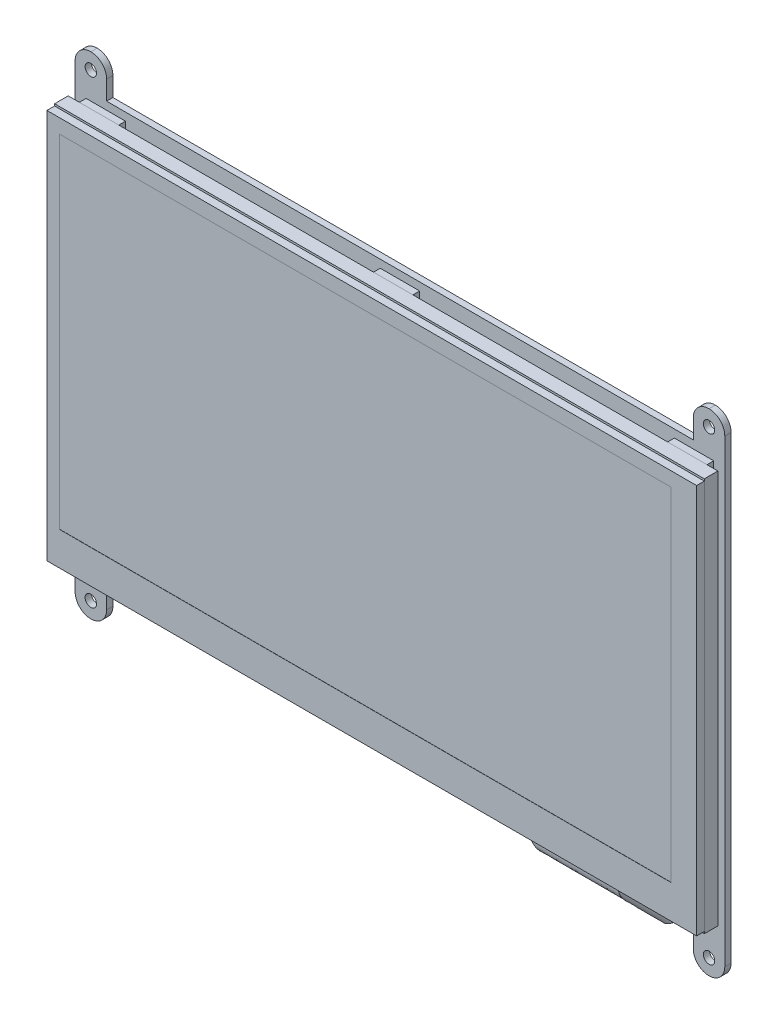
ISO-10303-21;
HEADER;
FILE_DESCRIPTION(('STEP AP214'),'2;1');
FILE_NAME('part.step','',(''),(''),'','','');
FILE_SCHEMA(('AUTOMOTIVE_DESIGN { 1 0 10303 214 1 1 1 1 }'));
ENDSEC;
DATA;
#1=APPLICATION_CONTEXT('core data for automotive mechanical design processes');
#2=APPLICATION_PROTOCOL_DEFINITION('international standard','automotive_design',2000,#1);
#3=PRODUCT_CONTEXT('',#1,'mechanical');
#4=PRODUCT('Part','Part','',(#3));
#5=PRODUCT_RELATED_PRODUCT_CATEGORY('part','',(#4));
#6=PRODUCT_DEFINITION_FORMATION('','',#4);
#7=PRODUCT_DEFINITION_CONTEXT('part definition',#1,'design');
#8=PRODUCT_DEFINITION('design','',#6,#7);
#9=PRODUCT_DEFINITION_SHAPE('','',#8);
#10=(LENGTH_UNIT() NAMED_UNIT(*) SI_UNIT(.MILLI.,.METRE.));
#11=(NAMED_UNIT(*) PLANE_ANGLE_UNIT() SI_UNIT($,.RADIAN.));
#12=(NAMED_UNIT(*) SI_UNIT($,.STERADIAN.) SOLID_ANGLE_UNIT());
#13=UNCERTAINTY_MEASURE_WITH_UNIT(LENGTH_MEASURE(1.E-05),#10,'distance_accuracy_value','');
#14=(GEOMETRIC_REPRESENTATION_CONTEXT(3) GLOBAL_UNCERTAINTY_ASSIGNED_CONTEXT((#13)) GLOBAL_UNIT_ASSIGNED_CONTEXT((#10,
#11,#12)) REPRESENTATION_CONTEXT('',''));
#15=CARTESIAN_POINT('',(0.,0.,0.));
#16=DIRECTION('',(0.,0.,1.));
#17=DIRECTION('',(1.,0.,0.));
#18=AXIS2_PLACEMENT_3D('',#15,#16,#17);
#19=CARTESIAN_POINT('',(-82.45,51.52,6.8));
#20=DIRECTION('',(1.,0.,0.));
#21=DIRECTION('',(0.,1.,0.));
#22=AXIS2_PLACEMENT_3D('',#19,#20,#21);
#23=PLANE('',#22);
#24=DIRECTION('',(0.,-1.,0.));
#25=VECTOR('',#24,1.);
#26=CARTESIAN_POINT('',(-82.45,51.52,3.35));
#27=LINE('',#26,#25);
#28=CARTESIAN_POINT('',(-82.45,51.52,3.35));
#29=VERTEX_POINT('',#28);
#30=CARTESIAN_POINT('',(-82.45,-48.48,3.35));
#31=VERTEX_POINT('',#30);
#32=EDGE_CURVE('E107',#29,#31,#27,.T.);
#33=ORIENTED_EDGE('',*,*,#32,.T.);
#34=DIRECTION('',(0.,0.,-1.));
#35=VECTOR('',#34,1.);
#36=CARTESIAN_POINT('',(-82.45,-48.48,6.8));
#37=LINE('',#36,#35);
#38=CARTESIAN_POINT('',(-82.45,-48.48,6.8));
#39=VERTEX_POINT('',#38);
#40=EDGE_CURVE('E12',#39,#31,#37,.T.);
#41=ORIENTED_EDGE('',*,*,#40,.F.);
#42=DIRECTION('',(0.,-1.,0.));
#43=VECTOR('',#42,1.);
#44=CARTESIAN_POINT('',(-82.45,51.52,6.8));
#45=LINE('',#44,#43);
#46=CARTESIAN_POINT('',(-82.45,51.52,6.8));
#47=VERTEX_POINT('',#46);
#48=EDGE_CURVE('E95',#47,#39,#45,.T.);
#49=ORIENTED_EDGE('',*,*,#48,.F.);
#50=DIRECTION('',(0.,0.,-1.));
#51=VECTOR('',#50,1.);
#52=CARTESIAN_POINT('',(-82.45,51.52,6.8));
#53=LINE('',#52,#51);
#54=EDGE_CURVE('E103',#47,#29,#53,.T.);
#55=ORIENTED_EDGE('',*,*,#54,.T.);
#56=EDGE_LOOP('',(#33,#41,#49,#55));
#57=FACE_BOUND('',#56,.T.);
#58=ADVANCED_FACE('F44',(#57),#23,.F.);
#59=CARTESIAN_POINT('',(-82.45,-48.48,6.8));
#60=DIRECTION('',(0.,1.,0.));
#61=DIRECTION('',(-1.,0.,0.));
#62=AXIS2_PLACEMENT_3D('',#59,#60,#61);
#63=PLANE('',#62);
#64=DIRECTION('',(1.,0.,0.));
#65=VECTOR('',#64,1.);
#66=CARTESIAN_POINT('',(-82.45,-48.48,3.35));
#67=LINE('',#66,#65);
#68=CARTESIAN_POINT('',(82.45,-48.48,3.35));
#69=VERTEX_POINT('',#68);
#70=EDGE_CURVE('E99',#31,#69,#67,.T.);
#71=ORIENTED_EDGE('',*,*,#70,.T.);
#72=DIRECTION('',(0.,0.,-1.));
#73=VECTOR('',#72,1.);
#74=CARTESIAN_POINT('',(82.45,-48.48,6.8));
#75=LINE('',#74,#73);
#76=CARTESIAN_POINT('',(82.45,-48.48,6.8));
#77=VERTEX_POINT('',#76);
#78=EDGE_CURVE('E52',#77,#69,#75,.T.);
#79=ORIENTED_EDGE('',*,*,#78,.F.);
#80=DIRECTION('',(1.,0.,0.));
#81=VECTOR('',#80,1.);
#82=CARTESIAN_POINT('',(-82.45,-48.48,6.8));
#83=LINE('',#82,#81);
#84=EDGE_CURVE('E90',#39,#77,#83,.T.);
#85=ORIENTED_EDGE('',*,*,#84,.F.);
#86=ORIENTED_EDGE('',*,*,#40,.T.);
#87=EDGE_LOOP('',(#71,#79,#85,#86));
#88=FACE_BOUND('',#87,.T.);
#89=ADVANCED_FACE('F98',(#88),#63,.F.);
#90=CARTESIAN_POINT('',(82.45,51.52,6.8));
#91=DIRECTION('',(-1.,0.,0.));
#92=DIRECTION('',(0.,0.,1.));
#93=AXIS2_PLACEMENT_3D('',#90,#91,#92);
#94=PLANE('',#93);
#95=DIRECTION('',(0.,1.,0.));
#96=VECTOR('',#95,1.);
#97=CARTESIAN_POINT('',(82.45,51.52,3.35));
#98=LINE('',#97,#96);
#99=CARTESIAN_POINT('',(82.45,51.52,3.35));
#100=VERTEX_POINT('',#99);
#101=EDGE_CURVE('E77',#69,#100,#98,.T.);
#102=ORIENTED_EDGE('',*,*,#101,.T.);
#103=DIRECTION('',(0.,0.,-1.));
#104=VECTOR('',#103,1.);
#105=CARTESIAN_POINT('',(82.45,51.52,6.8));
#106=LINE('',#105,#104);
#107=CARTESIAN_POINT('',(82.45,51.52,6.8));
#108=VERTEX_POINT('',#107);
#109=EDGE_CURVE('E100',#108,#100,#106,.T.);
#110=ORIENTED_EDGE('',*,*,#109,.F.);
#111=DIRECTION('',(0.,1.,0.));
#112=VECTOR('',#111,1.);
#113=CARTESIAN_POINT('',(82.45,51.52,6.8));
#114=LINE('',#113,#112);
#115=EDGE_CURVE('E93',#77,#108,#114,.T.);
#116=ORIENTED_EDGE('',*,*,#115,.F.);
#117=ORIENTED_EDGE('',*,*,#78,.T.);
#118=EDGE_LOOP('',(#102,#110,#116,#117));
#119=FACE_BOUND('',#118,.T.);
#120=ADVANCED_FACE('F101',(#119),#94,.F.);
#121=CARTESIAN_POINT('',(-82.45,51.52,6.8));
#122=DIRECTION('',(0.,-1.,0.));
#123=DIRECTION('',(0.,0.,-1.));
#124=AXIS2_PLACEMENT_3D('',#121,#122,#123);
#125=PLANE('',#124);
#126=DIRECTION('',(-1.,0.,0.));
#127=VECTOR('',#126,1.);
#128=CARTESIAN_POINT('',(-82.45,51.52,3.35));
#129=LINE('',#128,#127);
#130=EDGE_CURVE('E83',#100,#29,#129,.T.);
#131=ORIENTED_EDGE('',*,*,#130,.T.);
#132=ORIENTED_EDGE('',*,*,#54,.F.);
#133=DIRECTION('',(-1.,0.,0.));
#134=VECTOR('',#133,1.);
#135=CARTESIAN_POINT('',(-82.45,51.52,6.8));
#136=LINE('',#135,#134);
#137=EDGE_CURVE('E60',#108,#47,#136,.T.);
#138=ORIENTED_EDGE('',*,*,#137,.F.);
#139=ORIENTED_EDGE('',*,*,#109,.T.);
#140=EDGE_LOOP('',(#131,#132,#138,#139));
#141=FACE_BOUND('',#140,.T.);
#142=ADVANCED_FACE('F114',(#141),#125,.F.);
#143=CARTESIAN_POINT('',(0.,0.,6.8));
#144=DIRECTION('',(0.,0.,1.));
#145=DIRECTION('',(1.,0.,0.));
#146=AXIS2_PLACEMENT_3D('',#143,#144,#145);
#147=PLANE('',#146);
#148=ORIENTED_EDGE('',*,*,#48,.T.);
#149=ORIENTED_EDGE('',*,*,#84,.T.);
#150=ORIENTED_EDGE('',*,*,#115,.T.);
#151=ORIENTED_EDGE('',*,*,#137,.T.);
#152=EDGE_LOOP('',(#148,#149,#150,#151));
#153=FACE_BOUND('',#152,.T.);
#154=ADVANCED_FACE('F91',(#153),#147,.T.);
#155=CARTESIAN_POINT('',(0.,0.,3.35));
#156=DIRECTION('',(0.,0.,1.));
#157=DIRECTION('',(1.,0.,0.));
#158=AXIS2_PLACEMENT_3D('',#155,#156,#157);
#159=PLANE('',#158);
#160=ORIENTED_EDGE('',*,*,#32,.F.);
#161=ORIENTED_EDGE('',*,*,#130,.F.);
#162=ORIENTED_EDGE('',*,*,#101,.F.);
#163=ORIENTED_EDGE('',*,*,#70,.F.);
#164=EDGE_LOOP('',(#160,#161,#162,#163));
#165=FACE_BOUND('',#164,.T.);
#166=ADVANCED_FACE('F117',(#165),#159,.F.);
#167=CLOSED_SHELL('',(#58,#89,#120,#142,#154,#166));
#168=MANIFOLD_SOLID_BREP('B2',#167);
#169=CARTESIAN_POINT('',(75.98,-47.98,8.55));
#170=DIRECTION('',(-1.,0.,0.));
#171=DIRECTION('',(0.,0.,1.));
#172=AXIS2_PLACEMENT_3D('',#169,#170,#171);
#173=PLANE('',#172);
#174=CARTESIAN_POINT('',(75.98,-47.98,8.55));
#175=CARTESIAN_POINT('',(75.98,-50.9124034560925,7.72848927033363));
#176=CARTESIAN_POINT('',(75.98,-52.3822089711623,5.99019291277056));
#177=CARTESIAN_POINT('',(75.98,-51.8550514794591,2.82835555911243));
#178=CARTESIAN_POINT('',(75.98,-49.8527072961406,1.5010874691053));
#179=CARTESIAN_POINT('',(75.98,-46.1055615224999,1.5037101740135));
#180=B_SPLINE_CURVE_WITH_KNOTS('',3,(#174,#175,#176,#177,#178,#179),.UNSPECIFIED.,.F.,.F.,(4,2,
4),(0.,0.5,1.),.UNSPECIFIED.);
#181=CARTESIAN_POINT('',(75.98,-47.98,8.55));
#182=VERTEX_POINT('',#181);
#183=CARTESIAN_POINT('',(75.98,-48.5574002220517,8.37018203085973));
#184=VERTEX_POINT('',#183);
#185=EDGE_CURVE('E947',#182,#184,#180,.T.);
#186=ORIENTED_EDGE('',*,*,#185,.T.);
#187=DIRECTION('',(0.,0.,-1.));
#188=VECTOR('',#187,1.);
#189=CARTESIAN_POINT('',(75.98,-48.5574002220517,33.25));
#190=LINE('',#189,#188);
#191=CARTESIAN_POINT('',(75.98,-48.5574002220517,8.16666800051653));
#192=VERTEX_POINT('',#191);
#193=EDGE_CURVE('E531',#184,#192,#190,.T.);
#194=ORIENTED_EDGE('',*,*,#193,.T.);
#195=CARTESIAN_POINT('',(75.98,-47.98,8.35));
#196=CARTESIAN_POINT('',(75.98,-50.8821007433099,7.52122255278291));
#197=CARTESIAN_POINT('',(75.98,-52.1974291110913,5.82567521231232));
#198=CARTESIAN_POINT('',(75.98,-51.6417532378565,2.95370918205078));
#199=CARTESIAN_POINT('',(75.98,-49.7761018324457,1.68104913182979));
#200=CARTESIAN_POINT('',(75.98,-46.0515885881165,1.69628982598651));
#201=B_SPLINE_CURVE_WITH_KNOTS('',3,(#195,#196,#197,#198,#199,#200),.UNSPECIFIED.,.F.,.F.,(4,2,
4),(0.,0.5,1.),.UNSPECIFIED.);
#202=CARTESIAN_POINT('',(75.98,-47.98,8.35));
#203=VERTEX_POINT('',#202);
#204=EDGE_CURVE('E971',#203,#192,#201,.T.);
#205=ORIENTED_EDGE('',*,*,#204,.F.);
#206=DIRECTION('',(0.,0.,1.));
#207=VECTOR('',#206,1.);
#208=CARTESIAN_POINT('',(75.98,-47.98,8.55));
#209=LINE('',#208,#207);
#210=EDGE_CURVE('E967',#203,#182,#209,.T.);
#211=ORIENTED_EDGE('',*,*,#210,.T.);
#212=EDGE_LOOP('',(#186,#194,#205,#211));
#213=FACE_BOUND('',#212,.T.);
#214=ADVANCED_FACE('F167',(#213),#173,.F.);
#215=CARTESIAN_POINT('',(75.98,-48.5574002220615,1.92022054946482));
#216=VERTEX_POINT('',#215);
#217=CARTESIAN_POINT('',(75.98,-46.0515885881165,1.69628982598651));
#218=VERTEX_POINT('',#217);
#219=EDGE_CURVE('E953',#216,#218,#201,.T.);
#220=ORIENTED_EDGE('',*,*,#219,.F.);
#221=CARTESIAN_POINT('',(75.98,-48.5574002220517,1.72782580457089));
#222=VERTEX_POINT('',#221);
#223=EDGE_CURVE('E196',#216,#222,#190,.T.);
#224=ORIENTED_EDGE('',*,*,#223,.T.);
#225=CARTESIAN_POINT('',(75.98,-47.7687741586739,1.59999999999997));
#226=VERTEX_POINT('',#225);
#227=EDGE_CURVE('E976',#222,#226,#180,.T.);
#228=ORIENTED_EDGE('',*,*,#227,.T.);
#229=DIRECTION('',(0.,1.,0.));
#230=VECTOR('',#229,1.);
#231=CARTESIAN_POINT('',(75.98,0.,1.6));
#232=LINE('',#231,#230);
#233=CARTESIAN_POINT('',(75.98,-46.0785750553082,1.6));
#234=VERTEX_POINT('',#233);
#235=EDGE_CURVE('E827',#234,#226,#232,.F.);
#236=ORIENTED_EDGE('',*,*,#235,.F.);
#237=DIRECTION('',(0.,-0.269864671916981,-0.96289825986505));
#238=VECTOR('',#237,1.);
#239=CARTESIAN_POINT('',(75.98,-46.1055615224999,1.5037101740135));
#240=LINE('',#239,#238);
#241=EDGE_CURVE('E970',#218,#234,#240,.T.);
#242=ORIENTED_EDGE('',*,*,#241,.F.);
#243=EDGE_LOOP('',(#220,#224,#228,#236,#242));
#244=FACE_BOUND('',#243,.T.);
#245=ADVANCED_FACE('F597',(#244),#173,.F.);
#246=CARTESIAN_POINT('',(75.98,-47.98,8.55));
#247=CARTESIAN_POINT('',(75.98,-50.9124034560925,7.72848927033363));
#248=CARTESIAN_POINT('',(75.98,-52.3822089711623,5.99019291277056));
#249=CARTESIAN_POINT('',(75.98,-51.8550514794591,2.82835555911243));
#250=CARTESIAN_POINT('',(75.98,-49.8527072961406,1.5010874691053));
#251=CARTESIAN_POINT('',(75.98,-46.1055615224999,1.5037101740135));
#252=CARTESIAN_POINT('',(62.2800000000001,-47.98,8.55));
#253=CARTESIAN_POINT('',(62.2800000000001,-50.9124034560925,7.72848927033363));
#254=CARTESIAN_POINT('',(62.2800000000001,-52.3822089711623,5.99019291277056));
#255=CARTESIAN_POINT('',(62.2800000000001,-51.8550514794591,2.82835555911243));
#256=CARTESIAN_POINT('',(62.2800000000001,-49.8527072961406,1.5010874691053));
#257=CARTESIAN_POINT('',(62.2800000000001,-46.1055615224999,1.5037101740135));
#258=B_SPLINE_SURFACE_WITH_KNOTS('',1,3,((#246,#247,#248,#249,#250,#251),(#252,#253,#254,#255,
#256,#257)),.UNSPECIFIED.,.F.,.F.,.F.,(2,2),(4,2,4),(0.,1.),(0.,0.5,1.),.UNSPECIFIED.);
#259=CARTESIAN_POINT('',(75.9799999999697,-48.5574002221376,1.72782580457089));
#260=CARTESIAN_POINT('',(75.8606425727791,-48.6474182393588,1.74614139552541));
#261=CARTESIAN_POINT('',(75.7414119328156,-48.7373406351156,1.76580166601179));
#262=CARTESIAN_POINT('',(75.502876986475,-48.9172409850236,1.80815194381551));
#263=CARTESIAN_POINT('',(75.3835738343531,-49.0072180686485,1.83085212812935));
#264=CARTESIAN_POINT('',(75.1451440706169,-49.1870390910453,1.87955028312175));
#265=CARTESIAN_POINT('',(75.0260183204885,-49.2768823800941,1.90555491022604));
#266=CARTESIAN_POINT('',(74.7882040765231,-49.4562391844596,1.9611844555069));
#267=CARTESIAN_POINT('',(74.6695160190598,-49.5457523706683,1.99081231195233));
#268=CARTESIAN_POINT('',(74.425224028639,-49.7299946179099,2.05610270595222));
#269=CARTESIAN_POINT('',(74.2996649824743,-49.8246898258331,2.09203047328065));
#270=CARTESIAN_POINT('',(74.0496484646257,-50.0132494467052,2.16898582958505));
#271=CARTESIAN_POINT('',(73.9251901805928,-50.1071144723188,2.2100092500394));
#272=CARTESIAN_POINT('',(73.6777286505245,-50.2937471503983,2.29787995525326));
#273=CARTESIAN_POINT('',(73.55472397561,-50.3865158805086,2.3447208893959));
#274=CARTESIAN_POINT('',(73.3105612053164,-50.570660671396,2.4451856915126));
#275=CARTESIAN_POINT('',(73.1894019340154,-50.66203761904,2.49880501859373));
#276=CARTESIAN_POINT('',(72.9907423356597,-50.8118644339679,2.59430535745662));
#277=CARTESIAN_POINT('',(72.9125390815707,-50.8708444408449,2.63389304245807));
#278=CARTESIAN_POINT('',(72.7574447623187,-50.9878148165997,2.71701870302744));
#279=CARTESIAN_POINT('',(72.6805541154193,-51.0458048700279,2.76055791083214));
#280=CARTESIAN_POINT('',(72.52840429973,-51.1605545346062,2.852176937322));
#281=CARTESIAN_POINT('',(72.4531469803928,-51.21731275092,2.90026160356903));
#282=CARTESIAN_POINT('',(72.3058724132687,-51.328385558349,3.00093545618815));
#283=CARTESIAN_POINT('',(72.2338251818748,-51.3827227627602,3.05345526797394));
#284=CARTESIAN_POINT('',(72.0926970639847,-51.4891599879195,3.16429969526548));
#285=CARTESIAN_POINT('',(72.0236137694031,-51.5412618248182,3.22261946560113));
#286=CARTESIAN_POINT('',(71.8894963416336,-51.6424116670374,3.34598115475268));
#287=CARTESIAN_POINT('',(71.8244554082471,-51.6914648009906,3.4110112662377));
#288=CARTESIAN_POINT('',(71.7266103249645,-51.7652584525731,3.51936685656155));
#289=CARTESIAN_POINT('',(71.6919373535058,-51.7914084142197,3.56004907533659));
#290=CARTESIAN_POINT('',(71.6248087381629,-51.8420360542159,3.64418213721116));
#291=CARTESIAN_POINT('',(71.5923524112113,-51.8665142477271,3.6876321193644));
#292=CARTESIAN_POINT('',(71.5302129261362,-51.9133791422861,3.77739149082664));
#293=CARTESIAN_POINT('',(71.5005236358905,-51.9357704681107,3.82369416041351));
#294=CARTESIAN_POINT('',(71.4444136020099,-51.9780880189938,3.91938775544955));
#295=CARTESIAN_POINT('',(71.4179965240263,-51.9980114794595,3.96878205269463));
#296=CARTESIAN_POINT('',(71.3592554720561,-52.0423133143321,4.09134250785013));
#297=CARTESIAN_POINT('',(71.3288765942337,-52.0652247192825,4.16602983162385));
#298=CARTESIAN_POINT('',(71.290908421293,-52.0938598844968,4.28185426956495));
#299=CARTESIAN_POINT('',(71.2795219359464,-52.102447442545,4.32107905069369));
#300=CARTESIAN_POINT('',(71.2595028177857,-52.1175456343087,4.40060950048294));
#301=CARTESIAN_POINT('',(71.2508689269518,-52.1240572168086,4.44091466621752));
#302=CARTESIAN_POINT('',(71.2364601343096,-52.1349241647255,4.52265236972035));
#303=CARTESIAN_POINT('',(71.2307081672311,-52.1392622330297,4.56409126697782));
#304=CARTESIAN_POINT('',(71.2223118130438,-52.145594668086,4.64744669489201));
#305=CARTESIAN_POINT('',(71.2196662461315,-52.1475899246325,4.68936303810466));
#306=CARTESIAN_POINT('',(71.2175254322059,-52.1492045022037,4.77332844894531));
#307=CARTESIAN_POINT('',(71.2180305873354,-52.148823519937,4.81537753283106));
#308=CARTESIAN_POINT('',(71.2221355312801,-52.1457276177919,4.89922854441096));
#309=CARTESIAN_POINT('',(71.2257354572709,-52.1430125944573,4.94103046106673));
#310=CARTESIAN_POINT('',(71.2400622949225,-52.1322074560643,5.05802567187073));
#311=CARTESIAN_POINT('',(71.2542091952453,-52.121538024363,5.13259312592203));
#312=CARTESIAN_POINT('',(71.2909348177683,-52.0938399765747,5.2782873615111));
#313=CARTESIAN_POINT('',(71.3135166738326,-52.076808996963,5.34941285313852));
#314=CARTESIAN_POINT('',(71.3821279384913,-52.0250631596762,5.53166183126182));
#315=CARTESIAN_POINT('',(71.433928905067,-51.9859954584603,5.63938911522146));
#316=CARTESIAN_POINT('',(71.5208942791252,-51.9204071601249,5.79246081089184));
#317=CARTESIAN_POINT('',(71.551493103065,-51.8973298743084,5.84215028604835));
#318=CARTESIAN_POINT('',(71.615267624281,-51.8492318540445,5.93886900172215));
#319=CARTESIAN_POINT('',(71.6484426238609,-51.8242116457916,5.98589895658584));
#320=CARTESIAN_POINT('',(71.725024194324,-51.7664546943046,6.08830926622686));
#321=CARTESIAN_POINT('',(71.7689920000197,-51.7332946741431,6.14302642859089));
#322=CARTESIAN_POINT('',(71.8595369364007,-51.6650067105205,6.24902625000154));
#323=CARTESIAN_POINT('',(71.9061159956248,-51.6298773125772,6.30030630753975));
#324=CARTESIAN_POINT('',(72.0013718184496,-51.5580364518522,6.39973775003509));
#325=CARTESIAN_POINT('',(72.0500492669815,-51.521324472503,6.44788810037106));
#326=CARTESIAN_POINT('',(72.1494730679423,-51.446340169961,6.54168932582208));
#327=CARTESIAN_POINT('',(72.2002320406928,-51.4080583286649,6.58731912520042));
#328=CARTESIAN_POINT('',(72.3031549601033,-51.3304350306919,6.67594398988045));
#329=CARTESIAN_POINT('',(72.355318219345,-51.2910940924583,6.7189403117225));
#330=CARTESIAN_POINT('',(72.4608266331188,-51.2115208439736,6.80254564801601));
#331=CARTESIAN_POINT('',(72.5141714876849,-51.1712887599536,6.84315525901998));
#332=CARTESIAN_POINT('',(72.6754733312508,-51.049636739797,6.96156004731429));
#333=CARTESIAN_POINT('',(72.7849412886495,-50.9670772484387,7.0361373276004));
#334=CARTESIAN_POINT('',(73.0068962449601,-50.7996813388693,7.17805576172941));
#335=CARTESIAN_POINT('',(73.1193855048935,-50.7148432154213,7.24539129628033));
#336=CARTESIAN_POINT('',(73.346819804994,-50.5433148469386,7.37389166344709));
#337=CARTESIAN_POINT('',(73.4617688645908,-50.4566215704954,7.43504528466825));
#338=CARTESIAN_POINT('',(73.6936356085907,-50.2817503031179,7.55193764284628));
#339=CARTESIAN_POINT('',(73.8105564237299,-50.1935699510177,7.60766658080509));
#340=CARTESIAN_POINT('',(74.0459468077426,-50.0160411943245,7.71427794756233));
#341=CARTESIAN_POINT('',(74.1644180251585,-49.9266915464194,7.76515464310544));
#342=CARTESIAN_POINT('',(74.3952606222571,-49.752592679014,7.85953277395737));
#343=CARTESIAN_POINT('',(74.5075644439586,-49.6678944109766,7.90329462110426));
#344=CARTESIAN_POINT('',(74.7328956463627,-49.4979521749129,7.9872287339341));
#345=CARTESIAN_POINT('',(74.8459221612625,-49.4127088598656,8.02740465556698));
#346=CARTESIAN_POINT('',(75.0723828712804,-49.2419147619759,8.10440629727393));
#347=CARTESIAN_POINT('',(75.1858152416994,-49.1563653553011,8.1412404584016));
#348=CARTESIAN_POINT('',(75.4127774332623,-48.9851930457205,8.21176788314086));
#349=CARTESIAN_POINT('',(75.5263047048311,-48.8995720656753,8.24547405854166));
#350=CARTESIAN_POINT('',(75.7531547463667,-48.7284843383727,8.30992455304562));
#351=CARTESIAN_POINT('',(75.8664744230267,-48.6430199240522,8.34068593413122));
#352=CARTESIAN_POINT('',(75.98,-48.5574002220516,8.37018202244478));
#353=B_SPLINE_CURVE_WITH_KNOTS('',3,(#259,#260,#261,#262,#263,#264,#265,#266,#267,#268,#269,
#270,#271,#272,#273,#274,#275,#276,#277,#278,#279,#280,#281,#282,#283,#284,#285,#286,#287,#288,
#289,#290,#291,#292,#293,#294,#295,#296,#297,#298,#299,#300,#301,#302,#303,#304,#305,#306,#307,
#308,#309,#310,#311,#312,#313,#314,#315,#316,#317,#318,#319,#320,#321,#322,#323,#324,#325,#326,
#327,#328,#329,#330,#331,#332,#333,#334,#335,#336,#337,#338,#339,#340,#341,#342,#343,#344,#345,
#346,#347,#348,#349,#350,#351,#352),.UNSPECIFIED.,.F.,.F.,(4,2,2,2,2,2,2,2,2,2,2,2,2,2,2,2,2,2,
2,2,2,2,2,2,2,2,2,2,2,2,2,2,2,2,2,2,2,2,2,2,2,2,2,2,2,2,4),(0.,0.451847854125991,
0.905248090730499,1.35957657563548,1.81427597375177,2.29815048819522,2.78163174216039,
3.26458977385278,3.74722596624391,4.06410022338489,4.38107363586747,4.69838898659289,
5.01143151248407,5.32421469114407,5.63645659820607,5.81487192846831,5.99323202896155,
6.17118696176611,6.3493394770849,6.5996935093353,6.72477560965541,6.84980046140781,
6.97580507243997,7.10176181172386,7.22773462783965,7.35371302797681,7.58263120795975,
7.81163452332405,8.18657810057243,8.37475963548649,8.56289038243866,8.79561636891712,
9.02851655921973,9.26149335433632,9.49619003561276,9.73077384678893,9.96529877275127,
10.4332458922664,10.9015535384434,11.3706958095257,11.8406703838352,12.3111935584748,
12.7530816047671,13.1945138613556,13.6347980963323,14.073175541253,14.5088360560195),.UNSPECIFIED.);
#354=EDGE_CURVE('E541',#222,#184,#353,.T.);
#355=DIRECTION('',(-1.,0.,0.));
#356=VECTOR('',#355,1.);
#357=CARTESIAN_POINT('',(75.98,-47.98,8.55));
#358=LINE('',#357,#356);
#359=CARTESIAN_POINT('',(62.2800000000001,-47.98,8.55));
#360=VERTEX_POINT('',#359);
#361=EDGE_CURVE('E961',#182,#360,#358,.T.);
#362=CARTESIAN_POINT('',(62.2800000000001,-47.98,8.55));
#363=CARTESIAN_POINT('',(62.2800000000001,-50.9124034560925,7.72848927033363));
#364=CARTESIAN_POINT('',(62.2800000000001,-52.3822089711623,5.99019291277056));
#365=CARTESIAN_POINT('',(62.2800000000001,-51.8550514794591,2.82835555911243));
#366=CARTESIAN_POINT('',(62.2800000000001,-49.8527072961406,1.5010874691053));
#367=CARTESIAN_POINT('',(62.2800000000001,-46.1055615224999,1.5037101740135));
#368=B_SPLINE_CURVE_WITH_KNOTS('',3,(#362,#363,#364,#365,#366,#367),.UNSPECIFIED.,.F.,.F.,(4,2,
4),(0.,0.5,1.),.UNSPECIFIED.);
#369=CARTESIAN_POINT('',(62.2800000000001,-47.7687741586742,1.6));
#370=VERTEX_POINT('',#369);
#371=EDGE_CURVE('E954',#360,#370,#368,.T.);
#372=DIRECTION('',(-1.,0.,0.));
#373=VECTOR('',#372,1.);
#374=CARTESIAN_POINT('',(69.1300000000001,-47.7687741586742,1.6));
#375=LINE('',#374,#373);
#376=EDGE_CURVE('E812',#226,#370,#375,.T.);
#377=ORIENTED_EDGE('',*,*,#227,.F.);
#378=ORIENTED_EDGE('',*,*,#354,.T.);
#379=ORIENTED_EDGE('',*,*,#185,.F.);
#380=ORIENTED_EDGE('',*,*,#361,.T.);
#381=ORIENTED_EDGE('',*,*,#371,.T.);
#382=ORIENTED_EDGE('',*,*,#376,.F.);
#383=EDGE_LOOP('',(#377,#378,#379,#380,#381,#382));
#384=FACE_BOUND('',#383,.T.);
#385=ADVANCED_FACE('F603',(#384),#258,.T.);
#386=CARTESIAN_POINT('',(62.2800000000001,-47.98,8.35));
#387=CARTESIAN_POINT('',(62.2800000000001,-50.8821007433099,7.52122255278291));
#388=CARTESIAN_POINT('',(62.2800000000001,-52.1974291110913,5.82567521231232));
#389=CARTESIAN_POINT('',(62.2800000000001,-51.6417532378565,2.95370918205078));
#390=CARTESIAN_POINT('',(62.2800000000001,-49.7761018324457,1.68104913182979));
#391=CARTESIAN_POINT('',(62.2800000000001,-46.0515885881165,1.69628982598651));
#392=CARTESIAN_POINT('',(75.98,-47.98,8.35));
#393=CARTESIAN_POINT('',(75.98,-50.8821007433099,7.52122255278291));
#394=CARTESIAN_POINT('',(75.98,-52.1974291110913,5.82567521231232));
#395=CARTESIAN_POINT('',(75.98,-51.6417532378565,2.95370918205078));
#396=CARTESIAN_POINT('',(75.98,-49.7761018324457,1.68104913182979));
#397=CARTESIAN_POINT('',(75.98,-46.0515885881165,1.69628982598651));
#398=B_SPLINE_SURFACE_WITH_KNOTS('',1,3,((#386,#387,#388,#389,#390,#391),(#392,#393,#394,#395,
#396,#397)),.UNSPECIFIED.,.F.,.F.,.F.,(2,2),(4,2,4),(0.,1.),(0.,0.5,1.),.UNSPECIFIED.);
#399=CARTESIAN_POINT('',(75.9800000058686,-48.5574002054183,8.16666800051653));
#400=CARTESIAN_POINT('',(75.8804069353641,-48.6325121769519,8.14027081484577));
#401=CARTESIAN_POINT('',(75.7809809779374,-48.7074981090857,8.11286989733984));
#402=CARTESIAN_POINT('',(75.5824792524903,-48.8572058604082,8.05589931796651));
#403=CARTESIAN_POINT('',(75.483403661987,-48.9319275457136,8.02632868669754));
#404=CARTESIAN_POINT('',(75.2856924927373,-49.081039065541,7.96487595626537));
#405=CARTESIAN_POINT('',(75.1870569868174,-49.1554288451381,7.93299348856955));
#406=CARTESIAN_POINT('',(74.9893496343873,-49.3045374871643,7.86641891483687));
#407=CARTESIAN_POINT('',(74.890283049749,-49.3792523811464,7.83170224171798));
#408=CARTESIAN_POINT('',(74.6927998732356,-49.5281919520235,7.75953222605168));
#409=CARTESIAN_POINT('',(74.5943831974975,-49.602416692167,7.72207924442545));
#410=CARTESIAN_POINT('',(74.398313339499,-49.750290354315,7.64419167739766));
#411=CARTESIAN_POINT('',(74.3006600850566,-49.8239393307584,7.60375737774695));
#412=CARTESIAN_POINT('',(74.1006555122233,-49.9747805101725,7.51719224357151));
#413=CARTESIAN_POINT('',(73.9983574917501,-50.0519325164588,7.47086745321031));
#414=CARTESIAN_POINT('',(73.7949769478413,-50.2053198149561,7.37413877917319));
#415=CARTESIAN_POINT('',(73.6938945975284,-50.2815549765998,7.32373432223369));
#416=CARTESIAN_POINT('',(73.493197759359,-50.4329182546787,7.21831700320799));
#417=CARTESIAN_POINT('',(73.3935841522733,-50.5080457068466,7.16330149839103));
#418=CARTESIAN_POINT('',(73.1963278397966,-50.6568141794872,7.0480819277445));
#419=CARTESIAN_POINT('',(73.098684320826,-50.7304558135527,6.98788006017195));
#420=CARTESIAN_POINT('',(72.9059340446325,-50.8758258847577,6.86150096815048));
#421=CARTESIAN_POINT('',(72.8108261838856,-50.9475551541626,6.79532639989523));
#422=CARTESIAN_POINT('',(72.6239983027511,-51.0884586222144,6.65602030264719));
#423=CARTESIAN_POINT('',(72.5322751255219,-51.1576352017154,6.58289549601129));
#424=CARTESIAN_POINT('',(72.3749866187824,-51.276260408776,6.44698066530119));
#425=CARTESIAN_POINT('',(72.3084518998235,-51.3264401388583,6.38595715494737));
#426=CARTESIAN_POINT('',(72.1788464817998,-51.4241870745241,6.25840842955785));
#427=CARTESIAN_POINT('',(72.1157742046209,-51.4717554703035,6.19188575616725));
#428=CARTESIAN_POINT('',(71.9946160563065,-51.5631315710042,6.05288528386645));
#429=CARTESIAN_POINT('',(71.936502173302,-51.6069604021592,5.9804461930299));
#430=CARTESIAN_POINT('',(71.8266393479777,-51.6898176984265,5.8284340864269));
#431=CARTESIAN_POINT('',(71.7748799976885,-51.7288540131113,5.74887311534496));
#432=CARTESIAN_POINT('',(71.6893772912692,-51.79333918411,5.59788651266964));
#433=CARTESIAN_POINT('',(71.6540848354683,-51.8199563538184,5.52785436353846));
#434=CARTESIAN_POINT('',(71.5911629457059,-51.8674113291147,5.3824519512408));
#435=CARTESIAN_POINT('',(71.5635363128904,-51.8882470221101,5.30707974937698));
#436=CARTESIAN_POINT('',(71.5180380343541,-51.9225613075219,5.15063037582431));
#437=CARTESIAN_POINT('',(71.5002860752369,-51.9359496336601,5.06949610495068));
#438=CARTESIAN_POINT('',(71.4831377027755,-51.9488827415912,4.94584866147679));
#439=CARTESIAN_POINT('',(71.4790012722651,-51.9520023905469,4.90432519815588));
#440=CARTESIAN_POINT('',(71.4740510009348,-51.9557358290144,4.8209724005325));
#441=CARTESIAN_POINT('',(71.4732367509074,-51.956349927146,4.77914310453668));
#442=CARTESIAN_POINT('',(71.4757797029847,-51.9544320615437,4.66217832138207));
#443=CARTESIAN_POINT('',(71.4829865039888,-51.9489967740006,4.58711539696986));
#444=CARTESIAN_POINT('',(71.5081193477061,-51.9300418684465,4.43988840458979));
#445=CARTESIAN_POINT('',(71.5260567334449,-51.9165136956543,4.36772749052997));
#446=CARTESIAN_POINT('',(71.5757995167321,-51.8789982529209,4.21276222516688));
#447=CARTESIAN_POINT('',(71.6097754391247,-51.8533739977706,4.13106613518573));
#448=CARTESIAN_POINT('',(71.6876683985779,-51.7946280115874,3.97552039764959));
#449=CARTESIAN_POINT('',(71.7316037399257,-51.7614924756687,3.90168557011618));
#450=CARTESIAN_POINT('',(71.8181827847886,-51.6961955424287,3.77398364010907));
#451=CARTESIAN_POINT('',(71.8596970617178,-51.6648859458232,3.71888755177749));
#452=CARTESIAN_POINT('',(71.9463987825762,-51.5994964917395,3.61339156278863));
#453=CARTESIAN_POINT('',(71.9915887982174,-51.5654146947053,3.56299500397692));
#454=CARTESIAN_POINT('',(72.0848506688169,-51.4950776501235,3.46633740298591));
#455=CARTESIAN_POINT('',(72.1329287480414,-51.4588177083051,3.42008587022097));
#456=CARTESIAN_POINT('',(72.2312320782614,-51.3846784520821,3.3313774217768));
#457=CARTESIAN_POINT('',(72.2814568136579,-51.3467995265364,3.2889196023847));
#458=CARTESIAN_POINT('',(72.4213869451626,-51.2412658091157,3.17716368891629));
#459=CARTESIAN_POINT('',(72.5128132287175,-51.1723131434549,3.11124515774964));
#460=CARTESIAN_POINT('',(72.6992421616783,-51.031710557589,2.98759834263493));
#461=CARTESIAN_POINT('',(72.7942500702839,-50.960056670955,2.92988274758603));
#462=CARTESIAN_POINT('',(72.9867967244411,-50.8148401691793,2.82131297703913));
#463=CARTESIAN_POINT('',(73.0843372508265,-50.7412762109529,2.7704637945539));
#464=CARTESIAN_POINT('',(73.2818733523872,-50.5922967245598,2.67429242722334));
#465=CARTESIAN_POINT('',(73.3818809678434,-50.5168721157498,2.62900939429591));
#466=CARTESIAN_POINT('',(73.5831701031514,-50.3650621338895,2.54356861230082));
#467=CARTESIAN_POINT('',(73.6844503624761,-50.2886777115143,2.50340617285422));
#468=CARTESIAN_POINT('',(73.8880325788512,-50.1351383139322,2.42751042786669));
#469=CARTESIAN_POINT('',(73.990334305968,-50.0579835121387,2.39177614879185));
#470=CARTESIAN_POINT('',(74.1973070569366,-49.901887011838,2.32369069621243));
#471=CARTESIAN_POINT('',(74.3019904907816,-49.8229359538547,2.29139900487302));
#472=CARTESIAN_POINT('',(74.5120357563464,-49.6645221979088,2.23038012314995));
#473=CARTESIAN_POINT('',(74.6173977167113,-49.5850594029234,2.20165363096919));
#474=CARTESIAN_POINT('',(74.828667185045,-49.4257223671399,2.14740190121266));
#475=CARTESIAN_POINT('',(74.9345748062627,-49.3458480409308,2.12187735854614));
#476=CARTESIAN_POINT('',(75.1446082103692,-49.1874432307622,2.07423270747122));
#477=CARTESIAN_POINT('',(75.2487254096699,-49.1089192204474,2.05205298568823));
#478=CARTESIAN_POINT('',(75.457256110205,-48.9516477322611,2.01024277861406));
#479=CARTESIAN_POINT('',(75.5616695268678,-48.8729003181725,1.99061162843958));
#480=CARTESIAN_POINT('',(75.7706879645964,-48.7152609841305,1.95370488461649));
#481=CARTESIAN_POINT('',(75.8752928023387,-48.6363692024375,1.93642766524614));
#482=CARTESIAN_POINT('',(75.98,-48.557400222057,1.92022054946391));
#483=B_SPLINE_CURVE_WITH_KNOTS('',3,(#399,#400,#401,#402,#403,#404,#405,#406,#407,#408,#409,
#410,#411,#412,#413,#414,#415,#416,#417,#418,#419,#420,#421,#422,#423,#424,#425,#426,#427,#428,
#429,#430,#431,#432,#433,#434,#435,#436,#437,#438,#439,#440,#441,#442,#443,#444,#445,#446,#447,
#448,#449,#450,#451,#452,#453,#454,#455,#456,#457,#458,#459,#460,#461,#462,#463,#464,#465,#466,
#467,#468,#469,#470,#471,#472,#473,#474,#475,#476,#477,#478,#479,#480,#481,#482),.UNSPECIFIED.,
.F.,.F.,(4,2,2,2,2,2,2,2,2,2,2,2,2,2,2,2,2,2,2,2,2,2,2,2,2,2,2,2,2,2,2,2,2,2,2,2,2,2,2,2,2,4),
(0.,0.382513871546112,0.765199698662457,1.14794666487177,1.5344611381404,1.92092472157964,
2.30735131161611,2.71603113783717,3.1247684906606,3.53374172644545,3.94254246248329,
4.35116228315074,4.75939082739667,5.0690720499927,5.37861093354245,5.68626590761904,
5.99341005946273,6.24127489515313,6.4892301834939,6.74012875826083,6.86547961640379,
6.99081503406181,7.21621994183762,7.44186354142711,7.71668828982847,7.99202229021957,
8.2189789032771,8.44609569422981,8.67372086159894,8.9012916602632,9.29721087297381,
9.69373600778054,10.090547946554,10.4900081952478,10.889099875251,11.2881036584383,
11.693154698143,12.0982849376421,12.503502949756,12.9003193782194,13.2970320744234,
13.6934693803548),.UNSPECIFIED.);
#484=EDGE_CURVE('E42',#192,#216,#483,.T.);
#485=DIRECTION('',(1.,0.,0.));
#486=VECTOR('',#485,1.);
#487=CARTESIAN_POINT('',(75.98,-46.0515885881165,1.69628982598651));
#488=LINE('',#487,#486);
#489=CARTESIAN_POINT('',(62.2800000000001,-46.0515885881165,1.69628982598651));
#490=VERTEX_POINT('',#489);
#491=EDGE_CURVE('E946',#490,#218,#488,.T.);
#492=CARTESIAN_POINT('',(62.2800000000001,-47.98,8.35));
#493=CARTESIAN_POINT('',(62.2800000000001,-50.8821007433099,7.52122255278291));
#494=CARTESIAN_POINT('',(62.2800000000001,-52.1974291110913,5.82567521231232));
#495=CARTESIAN_POINT('',(62.2800000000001,-51.6417532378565,2.95370918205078));
#496=CARTESIAN_POINT('',(62.2800000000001,-49.7761018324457,1.68104913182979));
#497=CARTESIAN_POINT('',(62.2800000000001,-46.0515885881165,1.69628982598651));
#498=B_SPLINE_CURVE_WITH_KNOTS('',3,(#492,#493,#494,#495,#496,#497),.UNSPECIFIED.,.F.,.F.,(4,2,
4),(0.,0.5,1.),.UNSPECIFIED.);
#499=CARTESIAN_POINT('',(62.2800000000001,-47.98,8.35));
#500=VERTEX_POINT('',#499);
#501=EDGE_CURVE('E948',#500,#490,#498,.T.);
#502=DIRECTION('',(1.,0.,0.));
#503=VECTOR('',#502,1.);
#504=CARTESIAN_POINT('',(75.98,-47.98,8.35));
#505=LINE('',#504,#503);
#506=EDGE_CURVE('E943',#500,#203,#505,.T.);
#507=ORIENTED_EDGE('',*,*,#204,.T.);
#508=ORIENTED_EDGE('',*,*,#484,.T.);
#509=ORIENTED_EDGE('',*,*,#219,.T.);
#510=ORIENTED_EDGE('',*,*,#491,.F.);
#511=ORIENTED_EDGE('',*,*,#501,.F.);
#512=ORIENTED_EDGE('',*,*,#506,.T.);
#513=EDGE_LOOP('',(#507,#508,#509,#510,#511,#512));
#514=FACE_BOUND('',#513,.T.);
#515=ADVANCED_FACE('F606',(#514),#398,.T.);
#516=CARTESIAN_POINT('',(61.3800000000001,-47.98,7.));
#517=CARTESIAN_POINT('',(61.3800000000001,-49.1106753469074,7.46570031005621));
#518=CARTESIAN_POINT('',(61.3800000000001,-50.3257240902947,7.32997611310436));
#519=CARTESIAN_POINT('',(61.3800000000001,-52.0896412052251,6.05176293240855));
#520=CARTESIAN_POINT('',(61.3800000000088,-52.4920024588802,4.76035732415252));
#521=CARTESIAN_POINT('',(61.3799999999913,-51.1136554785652,2.52430035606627));
#522=CARTESIAN_POINT('',(61.3799999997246,-49.365903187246,1.58770387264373));
#523=CARTESIAN_POINT('',(61.3800000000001,-46.0419938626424,1.5069311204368));
#524=CARTESIAN_POINT('',(38.48,-47.98,7.));
#525=CARTESIAN_POINT('',(38.48,-49.1106753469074,7.46570031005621));
#526=CARTESIAN_POINT('',(38.48,-50.3257240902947,7.32997611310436));
#527=CARTESIAN_POINT('',(38.48,-52.0896412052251,6.05176293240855));
#528=CARTESIAN_POINT('',(38.4800000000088,-52.4920024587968,4.76035732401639));
#529=CARTESIAN_POINT('',(38.4799999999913,-51.1136554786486,2.52430035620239));
#530=CARTESIAN_POINT('',(38.4799999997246,-49.3659031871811,1.58770387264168));
#531=CARTESIAN_POINT('',(38.48,-46.0419938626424,1.5069311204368));
#532=B_SPLINE_SURFACE_WITH_KNOTS('',1,3,((#516,#517,#518,#519,#520,#521,#522,#523),(#524,#525,
#526,#527,#528,#529,#530,#531)),.UNSPECIFIED.,.F.,.F.,.F.,(2,2),(4,2,2,4),(0.,1.),(0.,
0.302586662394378,0.651293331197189,1.),.UNSPECIFIED.);
#533=CARTESIAN_POINT('',(38.48,-47.98,7.));
#534=CARTESIAN_POINT('',(38.48,-49.1106753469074,7.46570031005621));
#535=CARTESIAN_POINT('',(38.48,-50.3257240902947,7.32997611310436));
#536=CARTESIAN_POINT('',(38.48,-52.0896412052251,6.05176293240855));
#537=CARTESIAN_POINT('',(38.4800000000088,-52.4920024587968,4.76035732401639));
#538=CARTESIAN_POINT('',(38.4799999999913,-51.1136554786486,2.52430035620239));
#539=CARTESIAN_POINT('',(38.4799999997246,-49.3659031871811,1.58770387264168));
#540=CARTESIAN_POINT('',(38.48,-46.0419938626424,1.5069311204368));
#541=B_SPLINE_CURVE_WITH_KNOTS('',3,(#533,#534,#535,#536,#537,#538,#539,#540),.UNSPECIFIED.,.F.,
.F.,(4,2,2,4),(0.,0.302586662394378,0.651293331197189,1.),.UNSPECIFIED.);
#542=CARTESIAN_POINT('',(38.48,-47.98,7.));
#543=VERTEX_POINT('',#542);
#544=CARTESIAN_POINT('',(38.4799999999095,-48.5574002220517,7.18509178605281));
#545=VERTEX_POINT('',#544);
#546=EDGE_CURVE('E870',#543,#545,#541,.T.);
#547=CARTESIAN_POINT('',(38.4799999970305,-48.5574002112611,7.18509178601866));
#548=CARTESIAN_POINT('',(38.5572999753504,-48.673997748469,7.21222897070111));
#549=CARTESIAN_POINT('',(38.6352205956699,-48.7915314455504,7.23362652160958));
#550=CARTESIAN_POINT('',(38.7918625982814,-49.0278066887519,7.26465696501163));
#551=CARTESIAN_POINT('',(38.8705847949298,-49.1465494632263,7.27427636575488));
#552=CARTESIAN_POINT('',(39.0290306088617,-49.3855455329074,7.28143869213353));
#553=CARTESIAN_POINT('',(39.1087561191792,-49.5058016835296,7.27885484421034));
#554=CARTESIAN_POINT('',(39.2677016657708,-49.7455515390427,7.26085187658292));
#555=CARTESIAN_POINT('',(39.3469219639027,-49.8650456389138,7.24544006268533));
#556=CARTESIAN_POINT('',(39.5392803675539,-50.1551946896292,7.19124664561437));
#557=CARTESIAN_POINT('',(39.6518501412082,-50.3249923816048,7.14512424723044));
#558=CARTESIAN_POINT('',(39.8164815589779,-50.5733186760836,7.05290020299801));
#559=CARTESIAN_POINT('',(39.870581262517,-50.6549214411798,7.0183838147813));
#560=CARTESIAN_POINT('',(39.9769917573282,-50.8154286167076,6.94122089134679));
#561=CARTESIAN_POINT('',(40.0293030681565,-50.8943338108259,6.89857674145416));
#562=CARTESIAN_POINT('',(40.1195330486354,-51.0304346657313,6.81574126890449));
#563=CARTESIAN_POINT('',(40.157948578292,-51.0883797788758,6.77732254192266));
#564=CARTESIAN_POINT('',(40.2330231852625,-51.2016206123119,6.6952614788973));
#565=CARTESIAN_POINT('',(40.2696824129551,-51.2569165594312,6.65161959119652));
#566=CARTESIAN_POINT('',(40.376525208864,-51.4180758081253,6.51284305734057));
#567=CARTESIAN_POINT('',(40.4436781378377,-51.5193677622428,6.40976385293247));
#568=CARTESIAN_POINT('',(40.5553122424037,-51.6877541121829,6.20437884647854));
#569=CARTESIAN_POINT('',(40.6016906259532,-51.7577102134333,6.10543614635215));
#570=CARTESIAN_POINT('',(40.6849379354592,-51.8832785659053,5.89513730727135));
#571=CARTESIAN_POINT('',(40.721815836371,-51.9389043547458,5.78379302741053));
#572=CARTESIAN_POINT('',(40.778967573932,-52.0251107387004,5.56897513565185));
#573=CARTESIAN_POINT('',(40.8009336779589,-52.0582439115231,5.466980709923));
#574=CARTESIAN_POINT('',(40.8351531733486,-52.109859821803,5.25778096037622));
#575=CARTESIAN_POINT('',(40.8474140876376,-52.1283539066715,5.15057974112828));
#576=CARTESIAN_POINT('',(40.8612921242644,-52.1492872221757,4.93347315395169));
#577=CARTESIAN_POINT('',(40.8628672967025,-52.1516631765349,4.82355882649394));
#578=CARTESIAN_POINT('',(40.8550181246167,-52.1398236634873,4.60503146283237));
#579=CARTESIAN_POINT('',(40.8455940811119,-52.1256086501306,4.49641839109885));
#580=CARTESIAN_POINT('',(40.8173450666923,-52.0829984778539,4.29050448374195));
#581=CARTESIAN_POINT('',(40.7991391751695,-52.0555371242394,4.19291979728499));
#582=CARTESIAN_POINT('',(40.75481068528,-51.9886730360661,4.00388771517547));
#583=CARTESIAN_POINT('',(40.728685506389,-51.9492664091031,3.91244233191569));
#584=CARTESIAN_POINT('',(40.6561224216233,-51.839813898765,3.69578305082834));
#585=CARTESIAN_POINT('',(40.6058960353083,-51.7640535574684,3.57474184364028));
#586=CARTESIAN_POINT('',(40.4955967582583,-51.5976806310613,3.34841019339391));
#587=CARTESIAN_POINT('',(40.4355012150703,-51.507033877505,3.24315707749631));
#588=CARTESIAN_POINT('',(40.3202424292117,-51.3331801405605,3.06549871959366));
#589=CARTESIAN_POINT('',(40.2662214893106,-51.2516961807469,2.99061820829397));
#590=CARTESIAN_POINT('',(40.1547747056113,-51.083592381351,2.8495880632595));
#591=CARTESIAN_POINT('',(40.097346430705,-50.9969688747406,2.78344477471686));
#592=CARTESIAN_POINT('',(39.9796859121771,-50.819492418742,2.65864969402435));
#593=CARTESIAN_POINT('',(39.9194408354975,-50.7286201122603,2.60003792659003));
#594=CARTESIAN_POINT('',(39.7970358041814,-50.5439871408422,2.48976008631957));
#595=CARTESIAN_POINT('',(39.734875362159,-50.4502257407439,2.43809579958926));
#596=CARTESIAN_POINT('',(39.6078488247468,-50.2586217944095,2.33993917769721));
#597=CARTESIAN_POINT('',(39.5429534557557,-50.1607350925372,2.29357179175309));
#598=CARTESIAN_POINT('',(39.411991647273,-49.9631952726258,2.20647495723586));
#599=CARTESIAN_POINT('',(39.3459246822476,-49.8635413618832,2.16574811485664));
#600=CARTESIAN_POINT('',(39.2128703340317,-49.6628452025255,2.08930136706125));
#601=CARTESIAN_POINT('',(39.1458823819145,-49.5618020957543,2.05358472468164));
#602=CARTESIAN_POINT('',(39.0127404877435,-49.3609738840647,1.98740624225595));
#603=CARTESIAN_POINT('',(38.9466016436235,-49.261211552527,1.95684433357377));
#604=CARTESIAN_POINT('',(38.813870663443,-49.0610031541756,1.89961563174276));
#605=CARTESIAN_POINT('',(38.7472789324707,-48.9605576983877,1.87294574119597));
#606=CARTESIAN_POINT('',(38.6138400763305,-48.7592815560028,1.8231712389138));
#607=CARTESIAN_POINT('',(38.5469938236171,-48.6584521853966,1.80005898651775));
#608=CARTESIAN_POINT('',(38.4800000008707,-48.5574002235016,1.77851824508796));
#609=B_SPLINE_CURVE_WITH_KNOTS('',3,(#547,#548,#549,#550,#551,#552,#553,#554,#555,#556,#557,
#558,#559,#560,#561,#562,#563,#564,#565,#566,#567,#568,#569,#570,#571,#572,#573,#574,#575,#576,
#577,#578,#579,#580,#581,#582,#583,#584,#585,#586,#587,#588,#589,#590,#591,#592,#593,#594,#595,
#596,#597,#598,#599,#600,#601,#602,#603,#604,#605,#606,#607,#608),.UNSPECIFIED.,.F.,.F.,(4,2,2,
2,2,2,2,2,2,2,2,2,2,2,2,2,2,2,2,2,2,2,2,2,2,2,2,2,2,2,4),(0.,0.427396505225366,
0.855282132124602,1.28762257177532,1.71971695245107,2.34378766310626,2.65494389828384,
2.96600895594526,3.20408015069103,3.4421309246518,3.91760734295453,4.30539725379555,
4.69281947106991,5.01984225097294,5.34661129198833,5.67466241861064,6.00270456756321,
6.31040823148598,6.6182122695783,7.06975694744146,7.52235291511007,7.89127074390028,
8.26045503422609,8.63152658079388,9.00269334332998,9.38132670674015,9.76013443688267,
10.1391877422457,10.5097209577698,10.8799576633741,11.2493877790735),.UNSPECIFIED.);
#610=CARTESIAN_POINT('',(38.4799999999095,-48.5574002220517,1.77851824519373));
#611=VERTEX_POINT('',#610);
#612=EDGE_CURVE('E532',#545,#611,#609,.T.);
#613=CARTESIAN_POINT('',(38.4799999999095,-47.443985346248,1.60000000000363));
#614=VERTEX_POINT('',#613);
#615=EDGE_CURVE('E878',#611,#614,#541,.T.);
#616=DIRECTION('',(-1.,0.,0.));
#617=VECTOR('',#616,1.);
#618=CARTESIAN_POINT('',(49.9299999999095,-47.4439853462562,1.6));
#619=LINE('',#618,#617);
#620=CARTESIAN_POINT('',(61.3799999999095,-47.4439853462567,1.5999999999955));
#621=VERTEX_POINT('',#620);
#622=EDGE_CURVE('E906',#621,#614,#619,.T.);
#623=CARTESIAN_POINT('',(61.3800000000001,-47.98,7.));
#624=CARTESIAN_POINT('',(61.3800000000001,-49.1106753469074,7.46570031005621));
#625=CARTESIAN_POINT('',(61.3800000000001,-50.3257240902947,7.32997611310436));
#626=CARTESIAN_POINT('',(61.3800000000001,-52.0896412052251,6.05176293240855));
#627=CARTESIAN_POINT('',(61.3800000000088,-52.4920024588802,4.76035732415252));
#628=CARTESIAN_POINT('',(61.3799999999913,-51.1136554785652,2.52430035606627));
#629=CARTESIAN_POINT('',(61.3799999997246,-49.365903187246,1.58770387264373));
#630=CARTESIAN_POINT('',(61.3800000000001,-46.0419938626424,1.5069311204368));
#631=B_SPLINE_CURVE_WITH_KNOTS('',3,(#623,#624,#625,#626,#627,#628,#629,#630),.UNSPECIFIED.,.F.,
.F.,(4,2,2,4),(0.,0.302586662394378,0.651293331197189,1.),.UNSPECIFIED.);
#632=CARTESIAN_POINT('',(61.3800000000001,-47.98,7.));
#633=VERTEX_POINT('',#632);
#634=EDGE_CURVE('E857',#633,#621,#631,.T.);
#635=DIRECTION('',(-1.,0.,0.));
#636=VECTOR('',#635,1.);
#637=CARTESIAN_POINT('',(38.48,-47.98,7.));
#638=LINE('',#637,#636);
#639=EDGE_CURVE('E895',#633,#543,#638,.T.);
#640=ORIENTED_EDGE('',*,*,#546,.T.);
#641=ORIENTED_EDGE('',*,*,#612,.T.);
#642=ORIENTED_EDGE('',*,*,#615,.T.);
#643=ORIENTED_EDGE('',*,*,#622,.F.);
#644=ORIENTED_EDGE('',*,*,#634,.F.);
#645=ORIENTED_EDGE('',*,*,#639,.T.);
#646=EDGE_LOOP('',(#640,#641,#642,#643,#644,#645));
#647=FACE_BOUND('',#646,.T.);
#648=ADVANCED_FACE('F548',(#647),#532,.T.);
#649=CARTESIAN_POINT('',(38.48,-47.98,7.));
#650=DIRECTION('',(-1.,0.,0.));
#651=DIRECTION('',(0.,0.,1.));
#652=AXIS2_PLACEMENT_3D('',#649,#650,#651);
#653=PLANE('',#652);
#654=ORIENTED_EDGE('',*,*,#615,.F.);
#655=DIRECTION('',(0.,0.,-1.));
#656=VECTOR('',#655,1.);
#657=CARTESIAN_POINT('',(38.4799999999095,-48.5574002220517,33.25));
#658=LINE('',#657,#656);
#659=CARTESIAN_POINT('',(38.4799999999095,-48.5574002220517,1.96804540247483));
#660=VERTEX_POINT('',#659);
#661=EDGE_CURVE('E524',#660,#611,#658,.T.);
#662=ORIENTED_EDGE('',*,*,#661,.F.);
#663=CARTESIAN_POINT('',(38.48,-47.98,6.8));
#664=CARTESIAN_POINT('',(38.48,-49.0482427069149,7.26641797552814));
#665=CARTESIAN_POINT('',(38.48,-50.1979525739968,7.15696852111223));
#666=CARTESIAN_POINT('',(38.48,-51.8717114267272,6.02318684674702));
#667=CARTESIAN_POINT('',(38.4800000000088,-52.2904284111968,4.86054287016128));
#668=CARTESIAN_POINT('',(38.4799999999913,-51.0786643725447,2.74666236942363));
#669=CARTESIAN_POINT('',(38.4799999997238,-49.4152194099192,1.78739191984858));
#670=CARTESIAN_POINT('',(38.48,-46.1151562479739,1.6930688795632));
#671=B_SPLINE_CURVE_WITH_KNOTS('',3,(#663,#664,#665,#666,#667,#668,#669,#670),.UNSPECIFIED.,.F.,
.F.,(4,2,2,4),(0.,0.302586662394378,0.651293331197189,1.),.UNSPECIFIED.);
#672=CARTESIAN_POINT('',(38.48,-46.1151562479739,1.6930688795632));
#673=VERTEX_POINT('',#672);
#674=EDGE_CURVE('E855',#660,#673,#671,.T.);
#675=ORIENTED_EDGE('',*,*,#674,.T.);
#676=DIRECTION('',(0.,-0.365811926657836,0.930688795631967));
#677=VECTOR('',#676,1.);
#678=CARTESIAN_POINT('',(38.48,-46.0419938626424,1.5069311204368));
#679=LINE('',#678,#677);
#680=CARTESIAN_POINT('',(38.48,-46.0785750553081,1.6));
#681=VERTEX_POINT('',#680);
#682=EDGE_CURVE('E847',#681,#673,#679,.T.);
#683=ORIENTED_EDGE('',*,*,#682,.F.);
#684=DIRECTION('',(0.,1.,0.));
#685=VECTOR('',#684,1.);
#686=CARTESIAN_POINT('',(38.48,0.,1.6));
#687=LINE('',#686,#685);
#688=EDGE_CURVE('E843',#614,#681,#687,.T.);
#689=ORIENTED_EDGE('',*,*,#688,.F.);
#690=EDGE_LOOP('',(#654,#662,#675,#683,#689));
#691=FACE_BOUND('',#690,.T.);
#692=ADVANCED_FACE('F582',(#691),#653,.T.);
#693=CARTESIAN_POINT('',(38.48,-47.98,6.8));
#694=VERTEX_POINT('',#693);
#695=CARTESIAN_POINT('',(38.48,-48.5574002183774,6.99565987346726));
#696=VERTEX_POINT('',#695);
#697=EDGE_CURVE('E865',#694,#696,#671,.T.);
#698=ORIENTED_EDGE('',*,*,#697,.T.);
#699=EDGE_CURVE('E529',#545,#696,#658,.T.);
#700=ORIENTED_EDGE('',*,*,#699,.F.);
#701=ORIENTED_EDGE('',*,*,#546,.F.);
#702=DIRECTION('',(0.,0.,-1.));
#703=VECTOR('',#702,1.);
#704=CARTESIAN_POINT('',(38.48,-47.98,7.));
#705=LINE('',#704,#703);
#706=EDGE_CURVE('E864',#543,#694,#705,.T.);
#707=ORIENTED_EDGE('',*,*,#706,.T.);
#708=EDGE_LOOP('',(#698,#700,#701,#707));
#709=FACE_BOUND('',#708,.T.);
#710=ADVANCED_FACE('F580',(#709),#653,.T.);
#711=CARTESIAN_POINT('',(38.48,-47.98,6.8));
#712=CARTESIAN_POINT('',(38.48,-49.0482427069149,7.26641797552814));
#713=CARTESIAN_POINT('',(38.48,-50.1979525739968,7.15696852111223));
#714=CARTESIAN_POINT('',(38.48,-51.8717114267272,6.02318684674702));
#715=CARTESIAN_POINT('',(38.4800000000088,-52.2904284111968,4.86054287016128));
#716=CARTESIAN_POINT('',(38.4799999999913,-51.0786643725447,2.74666236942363));
#717=CARTESIAN_POINT('',(38.4799999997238,-49.4152194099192,1.78739191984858));
#718=CARTESIAN_POINT('',(38.48,-46.1151562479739,1.6930688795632));
#719=CARTESIAN_POINT('',(61.38,-47.98,6.8));
#720=CARTESIAN_POINT('',(61.38,-49.0482427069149,7.26641797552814));
#721=CARTESIAN_POINT('',(61.38,-50.1979525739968,7.15696852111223));
#722=CARTESIAN_POINT('',(61.38,-51.8717114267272,6.02318684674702));
#723=CARTESIAN_POINT('',(61.3800000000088,-52.2904284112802,4.86054287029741));
#724=CARTESIAN_POINT('',(61.3799999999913,-51.0786643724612,2.74666236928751));
#725=CARTESIAN_POINT('',(61.3799999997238,-49.4152194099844,1.78739191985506));
#726=CARTESIAN_POINT('',(61.38,-46.1151562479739,1.6930688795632));
#727=B_SPLINE_SURFACE_WITH_KNOTS('',1,3,((#711,#712,#713,#714,#715,#716,#717,#718),(#719,#720,
#721,#722,#723,#724,#725,#726)),.UNSPECIFIED.,.F.,.F.,.F.,(2,2),(4,2,2,4),(0.,1.),(0.,
0.302586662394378,0.651293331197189,1.),.UNSPECIFIED.);
#728=CARTESIAN_POINT('',(38.4799999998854,-48.557400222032,1.96804540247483));
#729=CARTESIAN_POINT('',(38.552781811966,-48.6671826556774,1.99201049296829));
#730=CARTESIAN_POINT('',(38.6253823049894,-48.776691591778,2.01788674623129));
#731=CARTESIAN_POINT('',(38.770347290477,-48.9953534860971,2.07406661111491));
#732=CARTESIAN_POINT('',(38.8427098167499,-49.1045034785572,2.10438678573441));
#733=CARTESIAN_POINT('',(38.986869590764,-49.3219508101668,2.16993083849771));
#734=CARTESIAN_POINT('',(39.0586658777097,-49.4302467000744,2.20516169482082));
#735=CARTESIAN_POINT('',(39.2022444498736,-49.6468173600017,2.2815898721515));
#736=CARTESIAN_POINT('',(39.2740158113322,-49.7550756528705,2.3228549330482));
#737=CARTESIAN_POINT('',(39.4162581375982,-49.9696307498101,2.41175082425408));
#738=CARTESIAN_POINT('',(39.4867305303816,-50.0759297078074,2.45937412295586));
#739=CARTESIAN_POINT('',(39.625977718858,-50.2859670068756,2.56192753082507));
#740=CARTESIAN_POINT('',(39.6947540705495,-50.3897076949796,2.61685062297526));
#741=CARTESIAN_POINT('',(39.8028489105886,-50.5527554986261,2.71138779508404));
#742=CARTESIAN_POINT('',(39.8428958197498,-50.6131613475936,2.74828130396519));
#743=CARTESIAN_POINT('',(39.9220078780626,-50.7324921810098,2.82539129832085));
#744=CARTESIAN_POINT('',(39.9610729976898,-50.7914171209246,2.8656078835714));
#745=CARTESIAN_POINT('',(40.0379913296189,-50.9074389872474,2.94966552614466));
#746=CARTESIAN_POINT('',(40.075844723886,-50.9645361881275,2.99350603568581));
#747=CARTESIAN_POINT('',(40.1500677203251,-51.0764924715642,3.08515665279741));
#748=CARTESIAN_POINT('',(40.1864371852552,-51.1313513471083,3.13296712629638));
#749=CARTESIAN_POINT('',(40.2578177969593,-51.2390202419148,3.23358843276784));
#750=CARTESIAN_POINT('',(40.2928034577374,-51.2917918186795,3.28645887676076));
#751=CARTESIAN_POINT('',(40.3604142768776,-51.393774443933,3.39700076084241));
#752=CARTESIAN_POINT('',(40.3930386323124,-51.4429842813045,3.45467381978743));
#753=CARTESIAN_POINT('',(40.4552305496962,-51.5367931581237,3.57492289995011));
#754=CARTESIAN_POINT('',(40.4848067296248,-51.5814051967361,3.63748416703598));
#755=CARTESIAN_POINT('',(40.5402334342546,-51.6650095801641,3.76773008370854));
#756=CARTESIAN_POINT('',(40.5660868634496,-51.7040063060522,3.8354106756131));
#757=CARTESIAN_POINT('',(40.6190467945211,-51.7838898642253,3.9925077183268));
#758=CARTESIAN_POINT('',(40.6449818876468,-51.8230097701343,4.08325866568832));
#759=CARTESIAN_POINT('',(40.6775383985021,-51.8721172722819,4.22404857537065));
#760=CARTESIAN_POINT('',(40.687330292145,-51.8868871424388,4.27173624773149));
#761=CARTESIAN_POINT('',(40.7046330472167,-51.912986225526,4.36844234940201));
#762=CARTESIAN_POINT('',(40.712144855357,-51.9243168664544,4.41746021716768));
#763=CARTESIAN_POINT('',(40.7247800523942,-51.9433755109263,4.51689460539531));
#764=CARTESIAN_POINT('',(40.7298845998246,-51.9510750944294,4.56731899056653));
#765=CARTESIAN_POINT('',(40.7375053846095,-51.9625701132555,4.66878633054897));
#766=CARTESIAN_POINT('',(40.7400226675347,-51.9663671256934,4.71982902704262));
#767=CARTESIAN_POINT('',(40.7424154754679,-51.9699763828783,4.82212128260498));
#768=CARTESIAN_POINT('',(40.742290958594,-51.9697885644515,4.87337084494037));
#769=CARTESIAN_POINT('',(40.7394110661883,-51.965444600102,4.9756169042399));
#770=CARTESIAN_POINT('',(40.7366555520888,-51.9612882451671,5.02661338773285));
#771=CARTESIAN_POINT('',(40.7252401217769,-51.9440694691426,5.16961834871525));
#772=CARTESIAN_POINT('',(40.7135890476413,-51.926495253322,5.26089374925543));
#773=CARTESIAN_POINT('',(40.6825252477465,-51.8796393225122,5.43891965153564));
#774=CARTESIAN_POINT('',(40.6631106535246,-51.8503547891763,5.52566905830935));
#775=CARTESIAN_POINT('',(40.6160307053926,-51.7793404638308,5.69889968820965));
#776=CARTESIAN_POINT('',(40.5878915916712,-51.7368960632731,5.78495618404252));
#777=CARTESIAN_POINT('',(40.5252598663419,-51.64242379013,5.94921722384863));
#778=CARTESIAN_POINT('',(40.4907587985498,-51.5903831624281,6.02741110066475));
#779=CARTESIAN_POINT('',(40.4262119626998,-51.4930221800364,6.15616945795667));
#780=CARTESIAN_POINT('',(40.3973177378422,-51.4494387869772,6.208653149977));
#781=CARTESIAN_POINT('',(40.3371461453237,-51.3586773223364,6.30881487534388));
#782=CARTESIAN_POINT('',(40.3058708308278,-51.3115023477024,6.35649696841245));
#783=CARTESIAN_POINT('',(40.2088877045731,-51.1652152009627,6.49248682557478));
#784=CARTESIAN_POINT('',(40.1400744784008,-51.0614188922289,6.5736374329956));
#785=CARTESIAN_POINT('',(39.9740199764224,-50.8109460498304,6.73924890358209));
#786=CARTESIAN_POINT('',(39.8746636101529,-50.6610791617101,6.81666276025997));
#787=CARTESIAN_POINT('',(39.6703589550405,-50.3529106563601,6.94212512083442));
#788=CARTESIAN_POINT('',(39.5653974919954,-50.1945891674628,6.99010080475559));
#789=CARTESIAN_POINT('',(39.3888803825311,-49.9283347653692,7.04770152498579));
#790=CARTESIAN_POINT('',(39.3180299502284,-49.8214655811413,7.06480895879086));
#791=CARTESIAN_POINT('',(39.1757712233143,-49.6068857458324,7.08797532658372));
#792=CARTESIAN_POINT('',(39.1043627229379,-49.4991747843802,7.09402997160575));
#793=CARTESIAN_POINT('',(38.8903697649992,-49.1763926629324,7.09626041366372));
#794=CARTESIAN_POINT('',(38.7476152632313,-48.9610650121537,7.07662678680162));
#795=CARTESIAN_POINT('',(38.5643300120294,-48.6846016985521,7.02500656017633));
#796=CARTESIAN_POINT('',(38.5220479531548,-48.6208244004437,7.01122851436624));
#797=CARTESIAN_POINT('',(38.48,-48.5574002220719,6.99565987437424));
#798=B_SPLINE_CURVE_WITH_KNOTS('',3,(#728,#729,#730,#731,#732,#733,#734,#735,#736,#737,#738,
#739,#740,#741,#742,#743,#744,#745,#746,#747,#748,#749,#750,#751,#752,#753,#754,#755,#756,#757,
#758,#759,#760,#761,#762,#763,#764,#765,#766,#767,#768,#769,#770,#771,#772,#773,#774,#775,#776,
#777,#778,#779,#780,#781,#782,#783,#784,#785,#786,#787,#788,#789,#790,#791,#792,#793,#794,#795,
#796,#797),.UNSPECIFIED.,.F.,.F.,(4,2,2,2,2,2,2,2,2,2,2,2,2,2,2,2,2,2,2,2,2,2,2,2,2,2,2,2,2,2,2,
2,2,2,4),(0.,0.401653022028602,0.804843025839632,1.20861192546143,1.61732205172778,
2.02555226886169,2.43339287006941,2.67729565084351,2.92120575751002,3.16507906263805,
3.40897487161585,3.65621731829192,3.90354344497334,4.1501499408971,4.39656297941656,
4.7017380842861,4.85420651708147,5.00661155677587,5.16019043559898,5.31370722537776,
5.46722644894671,5.62075375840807,5.90043543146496,6.18018445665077,6.47908032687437,
6.77837638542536,7.00035365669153,7.22214164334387,7.66612511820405,8.25031176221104,
8.83593771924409,9.2235416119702,9.61129588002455,10.3846130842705,10.6177543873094),.UNSPECIFIED.);
#799=EDGE_CURVE('E181',#660,#696,#798,.T.);
#800=DIRECTION('',(1.,0.,0.));
#801=VECTOR('',#800,1.);
#802=CARTESIAN_POINT('',(38.48,-47.98,6.8));
#803=LINE('',#802,#801);
#804=CARTESIAN_POINT('',(61.38,-47.98,6.8));
#805=VERTEX_POINT('',#804);
#806=EDGE_CURVE('E879',#694,#805,#803,.T.);
#807=CARTESIAN_POINT('',(61.38,-47.98,6.8));
#808=CARTESIAN_POINT('',(61.38,-49.0482427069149,7.26641797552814));
#809=CARTESIAN_POINT('',(61.38,-50.1979525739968,7.15696852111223));
#810=CARTESIAN_POINT('',(61.38,-51.8717114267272,6.02318684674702));
#811=CARTESIAN_POINT('',(61.3800000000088,-52.2904284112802,4.86054287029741));
#812=CARTESIAN_POINT('',(61.3799999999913,-51.0786643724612,2.74666236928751));
#813=CARTESIAN_POINT('',(61.3799999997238,-49.4152194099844,1.78739191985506));
#814=CARTESIAN_POINT('',(61.38,-46.1151562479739,1.6930688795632));
#815=B_SPLINE_CURVE_WITH_KNOTS('',3,(#807,#808,#809,#810,#811,#812,#813,#814),.UNSPECIFIED.,.F.,
.F.,(4,2,2,4),(0.,0.302586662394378,0.651293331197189,1.),.UNSPECIFIED.);
#816=CARTESIAN_POINT('',(61.38,-46.1151562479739,1.6930688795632));
#817=VERTEX_POINT('',#816);
#818=EDGE_CURVE('E861',#805,#817,#815,.T.);
#819=DIRECTION('',(1.,0.,0.));
#820=VECTOR('',#819,1.);
#821=CARTESIAN_POINT('',(38.48,-46.1151562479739,1.6930688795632));
#822=LINE('',#821,#820);
#823=EDGE_CURVE('E856',#673,#817,#822,.T.);
#824=ORIENTED_EDGE('',*,*,#674,.F.);
#825=ORIENTED_EDGE('',*,*,#799,.T.);
#826=ORIENTED_EDGE('',*,*,#697,.F.);
#827=ORIENTED_EDGE('',*,*,#806,.T.);
#828=ORIENTED_EDGE('',*,*,#818,.T.);
#829=ORIENTED_EDGE('',*,*,#823,.F.);
#830=EDGE_LOOP('',(#824,#825,#826,#827,#828,#829));
#831=FACE_BOUND('',#830,.T.);
#832=ADVANCED_FACE('F574',(#831),#727,.T.);
#833=CARTESIAN_POINT('',(0.,0.,1.6));
#834=DIRECTION('',(0.,0.,-1.));
#835=DIRECTION('',(-1.,0.,0.));
#836=AXIS2_PLACEMENT_3D('',#833,#834,#835);
#837=PLANE('',#836);
#838=DIRECTION('',(-1.,0.,0.));
#839=VECTOR('',#838,1.);
#840=CARTESIAN_POINT('',(0.,-46.0785750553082,1.6));
#841=LINE('',#840,#839);
#842=CARTESIAN_POINT('',(62.2800000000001,-46.0785750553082,1.6));
#843=VERTEX_POINT('',#842);
#844=EDGE_CURVE('E832',#234,#843,#841,.T.);
#845=ORIENTED_EDGE('',*,*,#844,.F.);
#846=ORIENTED_EDGE('',*,*,#235,.T.);
#847=ORIENTED_EDGE('',*,*,#376,.T.);
#848=DIRECTION('',(0.,1.,0.));
#849=VECTOR('',#848,1.);
#850=CARTESIAN_POINT('',(62.2800000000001,0.,1.6));
#851=LINE('',#850,#849);
#852=EDGE_CURVE('E830',#370,#843,#851,.T.);
#853=ORIENTED_EDGE('',*,*,#852,.T.);
#854=EDGE_LOOP('',(#845,#846,#847,#853));
#855=FACE_BOUND('',#854,.T.);
#856=DIRECTION('',(0.,1.,0.));
#857=VECTOR('',#856,1.);
#858=CARTESIAN_POINT('',(79.65,51.48,1.6));
#859=LINE('',#858,#857);
#860=CARTESIAN_POINT('',(79.65,-43.48,1.6));
#861=VERTEX_POINT('',#860);
#862=CARTESIAN_POINT('',(79.65,51.48,1.6));
#863=VERTEX_POINT('',#862);
#864=EDGE_CURVE('E1024',#861,#863,#859,.T.);
#865=ORIENTED_EDGE('',*,*,#864,.F.);
#866=DIRECTION('',(1.,0.,0.));
#867=VECTOR('',#866,1.);
#868=CARTESIAN_POINT('',(79.65,-43.48,1.6));
#869=LINE('',#868,#867);
#870=CARTESIAN_POINT('',(69.65,-43.48,1.6));
#871=VERTEX_POINT('',#870);
#872=EDGE_CURVE('E1029',#871,#861,#869,.T.);
#873=ORIENTED_EDGE('',*,*,#872,.F.);
#874=DIRECTION('',(0.,-1.,0.));
#875=VECTOR('',#874,1.);
#876=CARTESIAN_POINT('',(69.65,51.48,1.6));
#877=LINE('',#876,#875);
#878=CARTESIAN_POINT('',(69.65,51.48,1.6));
#879=VERTEX_POINT('',#878);
#880=EDGE_CURVE('E1041',#879,#871,#877,.T.);
#881=ORIENTED_EDGE('',*,*,#880,.F.);
#882=DIRECTION('',(-1.,0.,0.));
#883=VECTOR('',#882,1.);
#884=CARTESIAN_POINT('',(79.65,51.48,1.6));
#885=LINE('',#884,#883);
#886=EDGE_CURVE('E1038',#863,#879,#885,.T.);
#887=ORIENTED_EDGE('',*,*,#886,.F.);
#888=EDGE_LOOP('',(#865,#873,#881,#887));
#889=FACE_BOUND('',#888,.T.);
#890=CARTESIAN_POINT('',(-78.45,58.335,1.6));
#891=DIRECTION('',(0.,0.,-1.));
#892=DIRECTION('',(-1.,0.,0.));
#893=AXIS2_PLACEMENT_3D('',#890,#891,#892);
#894=CIRCLE('',#893,4.);
#895=CARTESIAN_POINT('',(-74.45,58.335,1.6));
#896=VERTEX_POINT('',#895);
#897=CARTESIAN_POINT('',(-78.45,62.335,1.6));
#898=VERTEX_POINT('',#897);
#899=EDGE_CURVE('E796',#896,#898,#894,.F.);
#900=ORIENTED_EDGE('',*,*,#899,.T.);
#901=CARTESIAN_POINT('',(-78.45,58.335,1.6));
#902=DIRECTION('',(0.,0.,-1.));
#903=DIRECTION('',(-1.,0.,0.));
#904=AXIS2_PLACEMENT_3D('',#901,#902,#903);
#905=CIRCLE('',#904,4.);
#906=CARTESIAN_POINT('',(-82.45,58.335,1.6));
#907=VERTEX_POINT('',#906);
#908=EDGE_CURVE('E798',#898,#907,#905,.F.);
#909=ORIENTED_EDGE('',*,*,#908,.T.);
#910=DIRECTION('',(0.,-1.,0.));
#911=VECTOR('',#910,1.);
#912=CARTESIAN_POINT('',(-82.45,62.335,1.6));
#913=LINE('',#912,#911);
#914=CARTESIAN_POINT('',(-82.45,-58.335,1.6));
#915=VERTEX_POINT('',#914);
#916=EDGE_CURVE('E1124',#907,#915,#913,.T.);
#917=ORIENTED_EDGE('',*,*,#916,.T.);
#918=CARTESIAN_POINT('',(-78.45,-58.335,1.6));
#919=DIRECTION('',(0.,0.,-1.));
#920=DIRECTION('',(-1.,0.,0.));
#921=AXIS2_PLACEMENT_3D('',#918,#919,#920);
#922=CIRCLE('',#921,4.);
#923=CARTESIAN_POINT('',(-78.45,-62.335,1.6));
#924=VERTEX_POINT('',#923);
#925=EDGE_CURVE('E794',#915,#924,#922,.F.);
#926=ORIENTED_EDGE('',*,*,#925,.T.);
#927=CARTESIAN_POINT('',(-78.45,-58.335,1.6));
#928=DIRECTION('',(0.,0.,-1.));
#929=DIRECTION('',(-1.,0.,0.));
#930=AXIS2_PLACEMENT_3D('',#927,#928,#929);
#931=CIRCLE('',#930,4.);
#932=CARTESIAN_POINT('',(-74.45,-58.335,1.6));
#933=VERTEX_POINT('',#932);
#934=EDGE_CURVE('E792',#924,#933,#931,.F.);
#935=ORIENTED_EDGE('',*,*,#934,.T.);
#936=DIRECTION('',(0.,1.,0.));
#937=VECTOR('',#936,1.);
#938=CARTESIAN_POINT('',(-74.45,-62.335,1.6));
#939=LINE('',#938,#937);
#940=CARTESIAN_POINT('',(-74.45,-53.48,1.6));
#941=VERTEX_POINT('',#940);
#942=EDGE_CURVE('E1127',#933,#941,#939,.T.);
#943=ORIENTED_EDGE('',*,*,#942,.T.);
#944=DIRECTION('',(1.,0.,0.));
#945=VECTOR('',#944,1.);
#946=CARTESIAN_POINT('',(-74.45,-53.48,1.6));
#947=LINE('',#946,#945);
#948=CARTESIAN_POINT('',(74.45,-53.48,1.6));
#949=VERTEX_POINT('',#948);
#950=EDGE_CURVE('E1129',#941,#949,#947,.T.);
#951=ORIENTED_EDGE('',*,*,#950,.T.);
#952=DIRECTION('',(0.,-1.,0.));
#953=VECTOR('',#952,1.);
#954=CARTESIAN_POINT('',(74.45,-62.335,1.6));
#955=LINE('',#954,#953);
#956=CARTESIAN_POINT('',(74.45,-58.335,1.6));
#957=VERTEX_POINT('',#956);
#958=EDGE_CURVE('E1131',#949,#957,#955,.T.);
#959=ORIENTED_EDGE('',*,*,#958,.T.);
#960=CARTESIAN_POINT('',(78.45,-58.335,1.6));
#961=DIRECTION('',(0.,0.,-1.));
#962=DIRECTION('',(-1.,0.,0.));
#963=AXIS2_PLACEMENT_3D('',#960,#961,#962);
#964=CIRCLE('',#963,4.);
#965=CARTESIAN_POINT('',(78.45,-62.335,1.6));
#966=VERTEX_POINT('',#965);
#967=EDGE_CURVE('E785',#957,#966,#964,.F.);
#968=ORIENTED_EDGE('',*,*,#967,.T.);
#969=CARTESIAN_POINT('',(78.45,-58.335,1.6));
#970=DIRECTION('',(0.,0.,-1.));
#971=DIRECTION('',(-1.,0.,0.));
#972=AXIS2_PLACEMENT_3D('',#969,#970,#971);
#973=CIRCLE('',#972,4.);
#974=CARTESIAN_POINT('',(82.45,-58.335,1.6));
#975=VERTEX_POINT('',#974);
#976=EDGE_CURVE('E782',#966,#975,#973,.F.);
#977=ORIENTED_EDGE('',*,*,#976,.T.);
#978=DIRECTION('',(0.,1.,0.));
#979=VECTOR('',#978,1.);
#980=CARTESIAN_POINT('',(82.45,62.335,1.6));
#981=LINE('',#980,#979);
#982=CARTESIAN_POINT('',(82.45,58.335,1.6));
#983=VERTEX_POINT('',#982);
#984=EDGE_CURVE('E1113',#975,#983,#981,.T.);
#985=ORIENTED_EDGE('',*,*,#984,.T.);
#986=CARTESIAN_POINT('',(78.45,58.335,1.6));
#987=DIRECTION('',(0.,0.,-1.));
#988=DIRECTION('',(-1.,0.,0.));
#989=AXIS2_PLACEMENT_3D('',#986,#987,#988);
#990=CIRCLE('',#989,4.);
#991=CARTESIAN_POINT('',(78.45,62.335,1.6));
#992=VERTEX_POINT('',#991);
#993=EDGE_CURVE('E783',#983,#992,#990,.F.);
#994=ORIENTED_EDGE('',*,*,#993,.T.);
#995=CARTESIAN_POINT('',(78.45,58.335,1.6));
#996=DIRECTION('',(0.,0.,-1.));
#997=DIRECTION('',(-1.,0.,0.));
#998=AXIS2_PLACEMENT_3D('',#995,#996,#997);
#999=CIRCLE('',#998,4.);
#1000=CARTESIAN_POINT('',(74.45,58.335,1.6));
#1001=VERTEX_POINT('',#1000);
#1002=EDGE_CURVE('E775',#992,#1001,#999,.F.);
#1003=ORIENTED_EDGE('',*,*,#1002,.T.);
#1004=DIRECTION('',(0.,-1.,0.));
#1005=VECTOR('',#1004,1.);
#1006=CARTESIAN_POINT('',(74.45,62.335,1.6));
#1007=LINE('',#1006,#1005);
#1008=CARTESIAN_POINT('',(74.45,53.48,1.6));
#1009=VERTEX_POINT('',#1008);
#1010=EDGE_CURVE('E1116',#1001,#1009,#1007,.T.);
#1011=ORIENTED_EDGE('',*,*,#1010,.T.);
#1012=DIRECTION('',(-1.,0.,0.));
#1013=VECTOR('',#1012,1.);
#1014=CARTESIAN_POINT('',(-74.45,53.48,1.6));
#1015=LINE('',#1014,#1013);
#1016=CARTESIAN_POINT('',(-74.45,53.48,1.6));
#1017=VERTEX_POINT('',#1016);
#1018=EDGE_CURVE('E1119',#1009,#1017,#1015,.T.);
#1019=ORIENTED_EDGE('',*,*,#1018,.T.);
#1020=DIRECTION('',(0.,1.,0.));
#1021=VECTOR('',#1020,1.);
#1022=CARTESIAN_POINT('',(-74.45,62.335,1.6));
#1023=LINE('',#1022,#1021);
#1024=EDGE_CURVE('E1121',#1017,#896,#1023,.T.);
#1025=ORIENTED_EDGE('',*,*,#1024,.T.);
#1026=EDGE_LOOP('',(#900,#909,#917,#926,#935,#943,#951,#959,#968,#977,#985,#994,#1003,#1011,
#1019,#1025));
#1027=FACE_BOUND('',#1026,.T.);
#1028=CARTESIAN_POINT('',(-78.45,58.335,1.6));
#1029=DIRECTION('',(0.,0.,1.));
#1030=DIRECTION('',(1.,0.,0.));
#1031=AXIS2_PLACEMENT_3D('',#1028,#1029,#1030);
#1032=CIRCLE('',#1031,1.45);
#1033=CARTESIAN_POINT('',(-77.,58.335,1.6));
#1034=VERTEX_POINT('',#1033);
#1035=EDGE_CURVE('E1094',#1034,#1034,#1032,.T.);
#1036=ORIENTED_EDGE('',*,*,#1035,.F.);
#1037=EDGE_LOOP('',(#1036));
#1038=FACE_BOUND('',#1037,.T.);
#1039=CARTESIAN_POINT('',(-78.45,-58.335,1.6));
#1040=DIRECTION('',(0.,0.,1.));
#1041=DIRECTION('',(1.,0.,0.));
#1042=AXIS2_PLACEMENT_3D('',#1039,#1040,#1041);
#1043=CIRCLE('',#1042,1.45);
#1044=CARTESIAN_POINT('',(-77.,-58.335,1.6));
#1045=VERTEX_POINT('',#1044);
#1046=EDGE_CURVE('E1090',#1045,#1045,#1043,.T.);
#1047=ORIENTED_EDGE('',*,*,#1046,.F.);
#1048=EDGE_LOOP('',(#1047));
#1049=FACE_BOUND('',#1048,.T.);
#1050=CARTESIAN_POINT('',(78.45,-58.335,1.6));
#1051=DIRECTION('',(0.,0.,1.));
#1052=DIRECTION('',(1.,0.,0.));
#1053=AXIS2_PLACEMENT_3D('',#1050,#1051,#1052);
#1054=CIRCLE('',#1053,1.45);
#1055=CARTESIAN_POINT('',(79.9,-58.335,1.6));
#1056=VERTEX_POINT('',#1055);
#1057=EDGE_CURVE('E1101',#1056,#1056,#1054,.T.);
#1058=ORIENTED_EDGE('',*,*,#1057,.F.);
#1059=EDGE_LOOP('',(#1058));
#1060=FACE_BOUND('',#1059,.T.);
#1061=CARTESIAN_POINT('',(78.45,58.335,1.6));
#1062=DIRECTION('',(0.,0.,1.));
#1063=DIRECTION('',(1.,0.,0.));
#1064=AXIS2_PLACEMENT_3D('',#1061,#1062,#1063);
#1065=CIRCLE('',#1064,1.45);
#1066=CARTESIAN_POINT('',(79.9,58.335,1.6));
#1067=VERTEX_POINT('',#1066);
#1068=EDGE_CURVE('E1095',#1067,#1067,#1065,.T.);
#1069=ORIENTED_EDGE('',*,*,#1068,.F.);
#1070=EDGE_LOOP('',(#1069));
#1071=FACE_BOUND('',#1070,.T.);
#1072=DIRECTION('',(0.,-1.,0.));
#1073=VECTOR('',#1072,1.);
#1074=CARTESIAN_POINT('',(-79.65,51.48,1.6));
#1075=LINE('',#1074,#1073);
#1076=CARTESIAN_POINT('',(-79.65,51.48,1.6));
#1077=VERTEX_POINT('',#1076);
#1078=CARTESIAN_POINT('',(-79.65,-43.48,1.6));
#1079=VERTEX_POINT('',#1078);
#1080=EDGE_CURVE('E1057',#1077,#1079,#1075,.T.);
#1081=ORIENTED_EDGE('',*,*,#1080,.F.);
#1082=DIRECTION('',(-1.,0.,0.));
#1083=VECTOR('',#1082,1.);
#1084=CARTESIAN_POINT('',(-79.65,51.48,1.6));
#1085=LINE('',#1084,#1083);
#1086=CARTESIAN_POINT('',(-69.65,51.48,1.6));
#1087=VERTEX_POINT('',#1086);
#1088=EDGE_CURVE('E1062',#1087,#1077,#1085,.T.);
#1089=ORIENTED_EDGE('',*,*,#1088,.F.);
#1090=DIRECTION('',(0.,1.,0.));
#1091=VECTOR('',#1090,1.);
#1092=CARTESIAN_POINT('',(-69.65,51.48,1.6));
#1093=LINE('',#1092,#1091);
#1094=CARTESIAN_POINT('',(-69.65,-43.48,1.6));
#1095=VERTEX_POINT('',#1094);
#1096=EDGE_CURVE('E1074',#1095,#1087,#1093,.T.);
#1097=ORIENTED_EDGE('',*,*,#1096,.F.);
#1098=DIRECTION('',(1.,0.,0.));
#1099=VECTOR('',#1098,1.);
#1100=CARTESIAN_POINT('',(-79.65,-43.48,1.6));
#1101=LINE('',#1100,#1099);
#1102=EDGE_CURVE('E1071',#1079,#1095,#1101,.T.);
#1103=ORIENTED_EDGE('',*,*,#1102,.F.);
#1104=EDGE_LOOP('',(#1081,#1089,#1097,#1103));
#1105=FACE_BOUND('',#1104,.T.);
#1106=DIRECTION('',(0.,-1.,0.));
#1107=VECTOR('',#1106,1.);
#1108=CARTESIAN_POINT('',(-4.99999999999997,51.48,1.6));
#1109=LINE('',#1108,#1107);
#1110=CARTESIAN_POINT('',(-4.99999999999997,51.48,1.6));
#1111=VERTEX_POINT('',#1110);
#1112=CARTESIAN_POINT('',(-4.99999999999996,-43.48,1.6));
#1113=VERTEX_POINT('',#1112);
#1114=EDGE_CURVE('E983',#1111,#1113,#1109,.T.);
#1115=ORIENTED_EDGE('',*,*,#1114,.F.);
#1116=DIRECTION('',(-1.,0.,0.));
#1117=VECTOR('',#1116,1.);
#1118=CARTESIAN_POINT('',(5.00000000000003,51.48,1.6));
#1119=LINE('',#1118,#1117);
#1120=CARTESIAN_POINT('',(5.00000000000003,51.48,1.6));
#1121=VERTEX_POINT('',#1120);
#1122=EDGE_CURVE('E996',#1121,#1111,#1119,.T.);
#1123=ORIENTED_EDGE('',*,*,#1122,.F.);
#1124=DIRECTION('',(0.,1.,0.));
#1125=VECTOR('',#1124,1.);
#1126=CARTESIAN_POINT('',(5.00000000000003,51.48,1.6));
#1127=LINE('',#1126,#1125);
#1128=CARTESIAN_POINT('',(5.00000000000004,-43.48,1.6));
#1129=VERTEX_POINT('',#1128);
#1130=EDGE_CURVE('E1008',#1129,#1121,#1127,.T.);
#1131=ORIENTED_EDGE('',*,*,#1130,.F.);
#1132=DIRECTION('',(1.,0.,0.));
#1133=VECTOR('',#1132,1.);
#1134=CARTESIAN_POINT('',(5.00000000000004,-43.48,1.6));
#1135=LINE('',#1134,#1133);
#1136=EDGE_CURVE('E1005',#1113,#1129,#1135,.T.);
#1137=ORIENTED_EDGE('',*,*,#1136,.F.);
#1138=EDGE_LOOP('',(#1115,#1123,#1131,#1137));
#1139=FACE_BOUND('',#1138,.T.);
#1140=ORIENTED_EDGE('',*,*,#688,.T.);
#1141=DIRECTION('',(1.,0.,0.));
#1142=VECTOR('',#1141,1.);
#1143=CARTESIAN_POINT('',(0.,-46.0785750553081,1.6));
#1144=LINE('',#1143,#1142);
#1145=CARTESIAN_POINT('',(61.3800000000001,-46.0785750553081,1.6));
#1146=VERTEX_POINT('',#1145);
#1147=EDGE_CURVE('E572',#681,#1146,#1144,.T.);
#1148=ORIENTED_EDGE('',*,*,#1147,.T.);
#1149=DIRECTION('',(0.,1.,0.));
#1150=VECTOR('',#1149,1.);
#1151=CARTESIAN_POINT('',(61.3800000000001,0.,1.6));
#1152=LINE('',#1151,#1150);
#1153=EDGE_CURVE('E841',#1146,#621,#1152,.F.);
#1154=ORIENTED_EDGE('',*,*,#1153,.T.);
#1155=ORIENTED_EDGE('',*,*,#622,.T.);
#1156=EDGE_LOOP('',(#1140,#1148,#1154,#1155));
#1157=FACE_BOUND('',#1156,.T.);
#1158=ADVANCED_FACE('F579',(#855,#889,#1027,#1038,#1049,#1060,#1071,#1105,#1139,#1157),#837,.F.);
#1159=CARTESIAN_POINT('',(82.45,62.335,1.6));
#1160=DIRECTION('',(-1.,0.,0.));
#1161=DIRECTION('',(0.,0.,1.));
#1162=AXIS2_PLACEMENT_3D('',#1159,#1160,#1161);
#1163=PLANE('',#1162);
#1164=ORIENTED_EDGE('',*,*,#984,.F.);
#1165=DIRECTION('',(0.,0.,-1.));
#1166=VECTOR('',#1165,1.);
#1167=CARTESIAN_POINT('',(82.45,-58.335,1.6));
#1168=LINE('',#1167,#1166);
#1169=CARTESIAN_POINT('',(82.45,-58.335,0.));
#1170=VERTEX_POINT('',#1169);
#1171=EDGE_CURVE('E809',#975,#1170,#1168,.T.);
#1172=ORIENTED_EDGE('',*,*,#1171,.T.);
#1173=DIRECTION('',(0.,1.,0.));
#1174=VECTOR('',#1173,1.);
#1175=CARTESIAN_POINT('',(82.45,62.335,0.));
#1176=LINE('',#1175,#1174);
#1177=CARTESIAN_POINT('',(82.45,58.335,0.));
#1178=VERTEX_POINT('',#1177);
#1179=EDGE_CURVE('E816',#1170,#1178,#1176,.T.);
#1180=ORIENTED_EDGE('',*,*,#1179,.T.);
#1181=DIRECTION('',(0.,0.,-1.));
#1182=VECTOR('',#1181,1.);
#1183=CARTESIAN_POINT('',(82.45,58.335,1.6));
#1184=LINE('',#1183,#1182);
#1185=EDGE_CURVE('E807',#1178,#983,#1184,.F.);
#1186=ORIENTED_EDGE('',*,*,#1185,.T.);
#1187=EDGE_LOOP('',(#1164,#1172,#1180,#1186));
#1188=FACE_BOUND('',#1187,.T.);
#1189=ADVANCED_FACE('F706',(#1188),#1163,.F.);
#1190=CARTESIAN_POINT('',(74.45,62.335,1.6));
#1191=DIRECTION('',(1.,0.,0.));
#1192=DIRECTION('',(0.,0.,-1.));
#1193=AXIS2_PLACEMENT_3D('',#1190,#1191,#1192);
#1194=PLANE('',#1193);
#1195=ORIENTED_EDGE('',*,*,#1010,.F.);
#1196=DIRECTION('',(0.,0.,-1.));
#1197=VECTOR('',#1196,1.);
#1198=CARTESIAN_POINT('',(74.45,58.335,1.6));
#1199=LINE('',#1198,#1197);
#1200=CARTESIAN_POINT('',(74.45,58.335,0.));
#1201=VERTEX_POINT('',#1200);
#1202=EDGE_CURVE('E779',#1001,#1201,#1199,.T.);
#1203=ORIENTED_EDGE('',*,*,#1202,.T.);
#1204=DIRECTION('',(0.,-1.,0.));
#1205=VECTOR('',#1204,1.);
#1206=CARTESIAN_POINT('',(74.45,62.335,0.));
#1207=LINE('',#1206,#1205);
#1208=CARTESIAN_POINT('',(74.45,53.48,0.));
#1209=VERTEX_POINT('',#1208);
#1210=EDGE_CURVE('E1137',#1201,#1209,#1207,.T.);
#1211=ORIENTED_EDGE('',*,*,#1210,.T.);
#1212=DIRECTION('',(0.,0.,-1.));
#1213=VECTOR('',#1212,1.);
#1214=CARTESIAN_POINT('',(74.45,53.48,1.6));
#1215=LINE('',#1214,#1213);
#1216=EDGE_CURVE('E1161',#1009,#1209,#1215,.T.);
#1217=ORIENTED_EDGE('',*,*,#1216,.F.);
#1218=EDGE_LOOP('',(#1195,#1203,#1211,#1217));
#1219=FACE_BOUND('',#1218,.T.);
#1220=ADVANCED_FACE('F736',(#1219),#1194,.F.);
#1221=CARTESIAN_POINT('',(-74.45,53.48,1.6));
#1222=DIRECTION('',(0.,-1.,0.));
#1223=DIRECTION('',(0.,0.,-1.));
#1224=AXIS2_PLACEMENT_3D('',#1221,#1222,#1223);
#1225=PLANE('',#1224);
#1226=DIRECTION('',(-1.,0.,0.));
#1227=VECTOR('',#1226,1.);
#1228=CARTESIAN_POINT('',(-74.45,53.48,0.));
#1229=LINE('',#1228,#1227);
#1230=CARTESIAN_POINT('',(-74.45,53.48,0.));
#1231=VERTEX_POINT('',#1230);
#1232=EDGE_CURVE('E1139',#1209,#1231,#1229,.T.);
#1233=ORIENTED_EDGE('',*,*,#1232,.T.);
#1234=DIRECTION('',(0.,0.,-1.));
#1235=VECTOR('',#1234,1.);
#1236=CARTESIAN_POINT('',(-74.45,53.48,1.6));
#1237=LINE('',#1236,#1235);
#1238=EDGE_CURVE('E1158',#1017,#1231,#1237,.T.);
#1239=ORIENTED_EDGE('',*,*,#1238,.F.);
#1240=ORIENTED_EDGE('',*,*,#1018,.F.);
#1241=ORIENTED_EDGE('',*,*,#1216,.T.);
#1242=EDGE_LOOP('',(#1233,#1239,#1240,#1241));
#1243=FACE_BOUND('',#1242,.T.);
#1244=ADVANCED_FACE('F732',(#1243),#1225,.F.);
#1245=CARTESIAN_POINT('',(-74.45,62.335,1.6));
#1246=DIRECTION('',(-1.,0.,0.));
#1247=DIRECTION('',(0.,0.,1.));
#1248=AXIS2_PLACEMENT_3D('',#1245,#1246,#1247);
#1249=PLANE('',#1248);
#1250=DIRECTION('',(0.,1.,0.));
#1251=VECTOR('',#1250,1.);
#1252=CARTESIAN_POINT('',(-74.45,62.335,0.));
#1253=LINE('',#1252,#1251);
#1254=CARTESIAN_POINT('',(-74.45,58.335,0.));
#1255=VERTEX_POINT('',#1254);
#1256=EDGE_CURVE('E1141',#1231,#1255,#1253,.T.);
#1257=ORIENTED_EDGE('',*,*,#1256,.T.);
#1258=DIRECTION('',(0.,0.,-1.));
#1259=VECTOR('',#1258,1.);
#1260=CARTESIAN_POINT('',(-74.45,58.335,1.6));
#1261=LINE('',#1260,#1259);
#1262=EDGE_CURVE('E800',#1255,#896,#1261,.F.);
#1263=ORIENTED_EDGE('',*,*,#1262,.T.);
#1264=ORIENTED_EDGE('',*,*,#1024,.F.);
#1265=ORIENTED_EDGE('',*,*,#1238,.T.);
#1266=EDGE_LOOP('',(#1257,#1263,#1264,#1265));
#1267=FACE_BOUND('',#1266,.T.);
#1268=ADVANCED_FACE('F728',(#1267),#1249,.F.);
#1269=CARTESIAN_POINT('',(-82.45,62.335,1.6));
#1270=DIRECTION('',(1.,0.,0.));
#1271=DIRECTION('',(0.,1.,0.));
#1272=AXIS2_PLACEMENT_3D('',#1269,#1270,#1271);
#1273=PLANE('',#1272);
#1274=ORIENTED_EDGE('',*,*,#916,.F.);
#1275=DIRECTION('',(0.,0.,-1.));
#1276=VECTOR('',#1275,1.);
#1277=CARTESIAN_POINT('',(-82.45,58.335,1.6));
#1278=LINE('',#1277,#1276);
#1279=CARTESIAN_POINT('',(-82.45,58.335,0.));
#1280=VERTEX_POINT('',#1279);
#1281=EDGE_CURVE('E1167',#907,#1280,#1278,.T.);
#1282=ORIENTED_EDGE('',*,*,#1281,.T.);
#1283=DIRECTION('',(0.,-1.,0.));
#1284=VECTOR('',#1283,1.);
#1285=CARTESIAN_POINT('',(-82.45,62.335,0.));
#1286=LINE('',#1285,#1284);
#1287=CARTESIAN_POINT('',(-82.45,-58.335,0.));
#1288=VERTEX_POINT('',#1287);
#1289=EDGE_CURVE('E1144',#1280,#1288,#1286,.T.);
#1290=ORIENTED_EDGE('',*,*,#1289,.T.);
#1291=DIRECTION('',(0.,0.,-1.));
#1292=VECTOR('',#1291,1.);
#1293=CARTESIAN_POINT('',(-82.45,-58.335,1.6));
#1294=LINE('',#1293,#1292);
#1295=EDGE_CURVE('E1164',#1288,#915,#1294,.F.);
#1296=ORIENTED_EDGE('',*,*,#1295,.T.);
#1297=EDGE_LOOP('',(#1274,#1282,#1290,#1296));
#1298=FACE_BOUND('',#1297,.T.);
#1299=ADVANCED_FACE('F724',(#1298),#1273,.F.);
#1300=CARTESIAN_POINT('',(-74.45,-62.335,1.6));
#1301=DIRECTION('',(-1.,0.,0.));
#1302=DIRECTION('',(0.,0.,1.));
#1303=AXIS2_PLACEMENT_3D('',#1300,#1301,#1302);
#1304=PLANE('',#1303);
#1305=ORIENTED_EDGE('',*,*,#942,.F.);
#1306=DIRECTION('',(0.,0.,-1.));
#1307=VECTOR('',#1306,1.);
#1308=CARTESIAN_POINT('',(-74.45,-58.335,1.6));
#1309=LINE('',#1308,#1307);
#1310=CARTESIAN_POINT('',(-74.45,-58.335,0.));
#1311=VERTEX_POINT('',#1310);
#1312=EDGE_CURVE('E802',#933,#1311,#1309,.T.);
#1313=ORIENTED_EDGE('',*,*,#1312,.T.);
#1314=DIRECTION('',(0.,1.,0.));
#1315=VECTOR('',#1314,1.);
#1316=CARTESIAN_POINT('',(-74.45,-62.335,0.));
#1317=LINE('',#1316,#1315);
#1318=CARTESIAN_POINT('',(-74.45,-53.48,0.));
#1319=VERTEX_POINT('',#1318);
#1320=EDGE_CURVE('E1147',#1311,#1319,#1317,.T.);
#1321=ORIENTED_EDGE('',*,*,#1320,.T.);
#1322=DIRECTION('',(0.,0.,-1.));
#1323=VECTOR('',#1322,1.);
#1324=CARTESIAN_POINT('',(-74.45,-53.48,1.6));
#1325=LINE('',#1324,#1323);
#1326=EDGE_CURVE('E1155',#941,#1319,#1325,.T.);
#1327=ORIENTED_EDGE('',*,*,#1326,.F.);
#1328=EDGE_LOOP('',(#1305,#1313,#1321,#1327));
#1329=FACE_BOUND('',#1328,.T.);
#1330=ADVANCED_FACE('F720',(#1329),#1304,.F.);
#1331=CARTESIAN_POINT('',(-74.45,-53.48,1.6));
#1332=DIRECTION('',(0.,1.,0.));
#1333=DIRECTION('',(0.,0.,1.));
#1334=AXIS2_PLACEMENT_3D('',#1331,#1332,#1333);
#1335=PLANE('',#1334);
#1336=DIRECTION('',(1.,0.,0.));
#1337=VECTOR('',#1336,1.);
#1338=CARTESIAN_POINT('',(-74.45,-53.48,0.));
#1339=LINE('',#1338,#1337);
#1340=CARTESIAN_POINT('',(74.45,-53.48,0.));
#1341=VERTEX_POINT('',#1340);
#1342=EDGE_CURVE('E1149',#1319,#1341,#1339,.T.);
#1343=ORIENTED_EDGE('',*,*,#1342,.T.);
#1344=DIRECTION('',(0.,0.,-1.));
#1345=VECTOR('',#1344,1.);
#1346=CARTESIAN_POINT('',(74.45,-53.48,1.6));
#1347=LINE('',#1346,#1345);
#1348=EDGE_CURVE('E1134',#949,#1341,#1347,.T.);
#1349=ORIENTED_EDGE('',*,*,#1348,.F.);
#1350=ORIENTED_EDGE('',*,*,#950,.F.);
#1351=ORIENTED_EDGE('',*,*,#1326,.T.);
#1352=EDGE_LOOP('',(#1343,#1349,#1350,#1351));
#1353=FACE_BOUND('',#1352,.T.);
#1354=ADVANCED_FACE('F716',(#1353),#1335,.F.);
#1355=CARTESIAN_POINT('',(74.45,-62.335,1.6));
#1356=DIRECTION('',(1.,0.,0.));
#1357=DIRECTION('',(0.,0.,-1.));
#1358=AXIS2_PLACEMENT_3D('',#1355,#1356,#1357);
#1359=PLANE('',#1358);
#1360=DIRECTION('',(0.,-1.,0.));
#1361=VECTOR('',#1360,1.);
#1362=CARTESIAN_POINT('',(74.45,-62.335,0.));
#1363=LINE('',#1362,#1361);
#1364=CARTESIAN_POINT('',(74.45,-58.335,0.));
#1365=VERTEX_POINT('',#1364);
#1366=EDGE_CURVE('E1117',#1341,#1365,#1363,.T.);
#1367=ORIENTED_EDGE('',*,*,#1366,.T.);
#1368=DIRECTION('',(0.,0.,-1.));
#1369=VECTOR('',#1368,1.);
#1370=CARTESIAN_POINT('',(74.45,-58.335,1.6));
#1371=LINE('',#1370,#1369);
#1372=EDGE_CURVE('E804',#1365,#957,#1371,.F.);
#1373=ORIENTED_EDGE('',*,*,#1372,.T.);
#1374=ORIENTED_EDGE('',*,*,#958,.F.);
#1375=ORIENTED_EDGE('',*,*,#1348,.T.);
#1376=EDGE_LOOP('',(#1367,#1373,#1374,#1375));
#1377=FACE_BOUND('',#1376,.T.);
#1378=ADVANCED_FACE('F712',(#1377),#1359,.F.);
#1379=CARTESIAN_POINT('',(0.,0.,0.));
#1380=DIRECTION('',(0.,0.,-1.));
#1381=DIRECTION('',(-1.,0.,0.));
#1382=AXIS2_PLACEMENT_3D('',#1379,#1380,#1381);
#1383=PLANE('',#1382);
#1384=CARTESIAN_POINT('',(78.45,58.335,0.));
#1385=DIRECTION('',(0.,0.,1.));
#1386=DIRECTION('',(1.,0.,0.));
#1387=AXIS2_PLACEMENT_3D('',#1384,#1385,#1386);
#1388=CIRCLE('',#1387,1.45);
#1389=CARTESIAN_POINT('',(79.9,58.335,0.));
#1390=VERTEX_POINT('',#1389);
#1391=EDGE_CURVE('E1091',#1390,#1390,#1388,.T.);
#1392=ORIENTED_EDGE('',*,*,#1391,.T.);
#1393=EDGE_LOOP('',(#1392));
#1394=FACE_BOUND('',#1393,.T.);
#1395=CARTESIAN_POINT('',(78.45,-58.335,0.));
#1396=DIRECTION('',(0.,0.,1.));
#1397=DIRECTION('',(1.,0.,0.));
#1398=AXIS2_PLACEMENT_3D('',#1395,#1396,#1397);
#1399=CIRCLE('',#1398,1.45);
#1400=CARTESIAN_POINT('',(79.9,-58.335,0.));
#1401=VERTEX_POINT('',#1400);
#1402=EDGE_CURVE('E1098',#1401,#1401,#1399,.T.);
#1403=ORIENTED_EDGE('',*,*,#1402,.T.);
#1404=EDGE_LOOP('',(#1403));
#1405=FACE_BOUND('',#1404,.T.);
#1406=CARTESIAN_POINT('',(-78.45,-58.335,0.));
#1407=DIRECTION('',(0.,0.,1.));
#1408=DIRECTION('',(1.,0.,0.));
#1409=AXIS2_PLACEMENT_3D('',#1406,#1407,#1408);
#1410=CIRCLE('',#1409,1.45);
#1411=CARTESIAN_POINT('',(-77.,-58.335,0.));
#1412=VERTEX_POINT('',#1411);
#1413=EDGE_CURVE('E1104',#1412,#1412,#1410,.T.);
#1414=ORIENTED_EDGE('',*,*,#1413,.T.);
#1415=EDGE_LOOP('',(#1414));
#1416=FACE_BOUND('',#1415,.T.);
#1417=CARTESIAN_POINT('',(-78.45,58.335,0.));
#1418=DIRECTION('',(0.,0.,1.));
#1419=DIRECTION('',(1.,0.,0.));
#1420=AXIS2_PLACEMENT_3D('',#1417,#1418,#1419);
#1421=CIRCLE('',#1420,1.45);
#1422=CARTESIAN_POINT('',(-77.,58.335,0.));
#1423=VERTEX_POINT('',#1422);
#1424=EDGE_CURVE('E824',#1423,#1423,#1421,.T.);
#1425=ORIENTED_EDGE('',*,*,#1424,.T.);
#1426=EDGE_LOOP('',(#1425));
#1427=FACE_BOUND('',#1426,.T.);
#1428=ORIENTED_EDGE('',*,*,#1289,.F.);
#1429=CARTESIAN_POINT('',(-78.45,58.335,0.));
#1430=DIRECTION('',(0.,0.,-1.));
#1431=DIRECTION('',(-1.,0.,0.));
#1432=AXIS2_PLACEMENT_3D('',#1429,#1430,#1431);
#1433=CIRCLE('',#1432,4.);
#1434=CARTESIAN_POINT('',(-78.45,62.335,0.));
#1435=VERTEX_POINT('',#1434);
#1436=EDGE_CURVE('E787',#1280,#1435,#1433,.T.);
#1437=ORIENTED_EDGE('',*,*,#1436,.T.);
#1438=CARTESIAN_POINT('',(-78.45,58.335,0.));
#1439=DIRECTION('',(0.,0.,-1.));
#1440=DIRECTION('',(-1.,0.,0.));
#1441=AXIS2_PLACEMENT_3D('',#1438,#1439,#1440);
#1442=CIRCLE('',#1441,4.);
#1443=EDGE_CURVE('E1182',#1435,#1255,#1442,.T.);
#1444=ORIENTED_EDGE('',*,*,#1443,.T.);
#1445=ORIENTED_EDGE('',*,*,#1256,.F.);
#1446=ORIENTED_EDGE('',*,*,#1232,.F.);
#1447=ORIENTED_EDGE('',*,*,#1210,.F.);
#1448=CARTESIAN_POINT('',(78.45,58.335,0.));
#1449=DIRECTION('',(0.,0.,-1.));
#1450=DIRECTION('',(-1.,0.,0.));
#1451=AXIS2_PLACEMENT_3D('',#1448,#1449,#1450);
#1452=CIRCLE('',#1451,4.);
#1453=CARTESIAN_POINT('',(78.45,62.335,0.));
#1454=VERTEX_POINT('',#1453);
#1455=EDGE_CURVE('E1172',#1201,#1454,#1452,.T.);
#1456=ORIENTED_EDGE('',*,*,#1455,.T.);
#1457=CARTESIAN_POINT('',(78.45,58.335,0.));
#1458=DIRECTION('',(0.,0.,-1.));
#1459=DIRECTION('',(-1.,0.,0.));
#1460=AXIS2_PLACEMENT_3D('',#1457,#1458,#1459);
#1461=CIRCLE('',#1460,4.);
#1462=EDGE_CURVE('E1170',#1454,#1178,#1461,.T.);
#1463=ORIENTED_EDGE('',*,*,#1462,.T.);
#1464=ORIENTED_EDGE('',*,*,#1179,.F.);
#1465=CARTESIAN_POINT('',(78.45,-58.335,0.));
#1466=DIRECTION('',(0.,0.,-1.));
#1467=DIRECTION('',(-1.,0.,0.));
#1468=AXIS2_PLACEMENT_3D('',#1465,#1466,#1467);
#1469=CIRCLE('',#1468,4.);
#1470=CARTESIAN_POINT('',(78.45,-62.335,0.));
#1471=VERTEX_POINT('',#1470);
#1472=EDGE_CURVE('E1174',#1170,#1471,#1469,.T.);
#1473=ORIENTED_EDGE('',*,*,#1472,.T.);
#1474=CARTESIAN_POINT('',(78.45,-58.335,0.));
#1475=DIRECTION('',(0.,0.,-1.));
#1476=DIRECTION('',(-1.,0.,0.));
#1477=AXIS2_PLACEMENT_3D('',#1474,#1475,#1476);
#1478=CIRCLE('',#1477,4.);
#1479=EDGE_CURVE('E1176',#1471,#1365,#1478,.T.);
#1480=ORIENTED_EDGE('',*,*,#1479,.T.);
#1481=ORIENTED_EDGE('',*,*,#1366,.F.);
#1482=ORIENTED_EDGE('',*,*,#1342,.F.);
#1483=ORIENTED_EDGE('',*,*,#1320,.F.);
#1484=CARTESIAN_POINT('',(-78.45,-58.335,0.));
#1485=DIRECTION('',(0.,0.,-1.));
#1486=DIRECTION('',(-1.,0.,0.));
#1487=AXIS2_PLACEMENT_3D('',#1484,#1485,#1486);
#1488=CIRCLE('',#1487,4.);
#1489=CARTESIAN_POINT('',(-78.45,-62.335,0.));
#1490=VERTEX_POINT('',#1489);
#1491=EDGE_CURVE('E1178',#1311,#1490,#1488,.T.);
#1492=ORIENTED_EDGE('',*,*,#1491,.T.);
#1493=CARTESIAN_POINT('',(-78.45,-58.335,0.));
#1494=DIRECTION('',(0.,0.,-1.));
#1495=DIRECTION('',(-1.,0.,0.));
#1496=AXIS2_PLACEMENT_3D('',#1493,#1494,#1495);
#1497=CIRCLE('',#1496,4.);
#1498=EDGE_CURVE('E1180',#1490,#1288,#1497,.T.);
#1499=ORIENTED_EDGE('',*,*,#1498,.T.);
#1500=EDGE_LOOP('',(#1428,#1437,#1444,#1445,#1446,#1447,#1456,#1463,#1464,#1473,#1480,#1481,
#1482,#1483,#1492,#1499));
#1501=FACE_BOUND('',#1500,.T.);
#1502=ADVANCED_FACE('F708',(#1394,#1405,#1416,#1427,#1501),#1383,.T.);
#1503=CARTESIAN_POINT('',(-78.45,58.335,1.6));
#1504=DIRECTION('',(0.,0.,-1.));
#1505=DIRECTION('',(-1.,0.,0.));
#1506=AXIS2_PLACEMENT_3D('',#1503,#1504,#1505);
#1507=CYLINDRICAL_SURFACE('',#1506,4.);
#1508=DIRECTION('',(0.,0.,-1.));
#1509=VECTOR('',#1508,1.);
#1510=CARTESIAN_POINT('',(-78.45,62.335,1.6));
#1511=LINE('',#1510,#1509);
#1512=EDGE_CURVE('E813',#898,#1435,#1511,.T.);
#1513=ORIENTED_EDGE('',*,*,#1512,.F.);
#1514=ORIENTED_EDGE('',*,*,#899,.F.);
#1515=ORIENTED_EDGE('',*,*,#1262,.F.);
#1516=ORIENTED_EDGE('',*,*,#1443,.F.);
#1517=EDGE_LOOP('',(#1513,#1514,#1515,#1516));
#1518=FACE_BOUND('',#1517,.T.);
#1519=ADVANCED_FACE('F711',(#1518),#1507,.T.);
#1520=CARTESIAN_POINT('',(-78.45,58.335,1.6));
#1521=DIRECTION('',(0.,0.,-1.));
#1522=DIRECTION('',(-1.,0.,0.));
#1523=AXIS2_PLACEMENT_3D('',#1520,#1521,#1522);
#1524=CYLINDRICAL_SURFACE('',#1523,4.);
#1525=ORIENTED_EDGE('',*,*,#908,.F.);
#1526=ORIENTED_EDGE('',*,*,#1512,.T.);
#1527=ORIENTED_EDGE('',*,*,#1436,.F.);
#1528=ORIENTED_EDGE('',*,*,#1281,.F.);
#1529=EDGE_LOOP('',(#1525,#1526,#1527,#1528));
#1530=FACE_BOUND('',#1529,.T.);
#1531=ADVANCED_FACE('F744',(#1530),#1524,.T.);
#1532=CARTESIAN_POINT('',(-78.45,-58.335,1.6));
#1533=DIRECTION('',(0.,0.,-1.));
#1534=DIRECTION('',(-1.,0.,0.));
#1535=AXIS2_PLACEMENT_3D('',#1532,#1533,#1534);
#1536=CYLINDRICAL_SURFACE('',#1535,4.);
#1537=ORIENTED_EDGE('',*,*,#1312,.F.);
#1538=ORIENTED_EDGE('',*,*,#934,.F.);
#1539=DIRECTION('',(0.,0.,-1.));
#1540=VECTOR('',#1539,1.);
#1541=CARTESIAN_POINT('',(-78.45,-62.335,1.6));
#1542=LINE('',#1541,#1540);
#1543=EDGE_CURVE('E817',#1490,#924,#1542,.F.);
#1544=ORIENTED_EDGE('',*,*,#1543,.F.);
#1545=ORIENTED_EDGE('',*,*,#1491,.F.);
#1546=EDGE_LOOP('',(#1537,#1538,#1544,#1545));
#1547=FACE_BOUND('',#1546,.T.);
#1548=ADVANCED_FACE('F747',(#1547),#1536,.T.);
#1549=CARTESIAN_POINT('',(-78.45,-58.335,1.6));
#1550=DIRECTION('',(0.,0.,-1.));
#1551=DIRECTION('',(-1.,0.,0.));
#1552=AXIS2_PLACEMENT_3D('',#1549,#1550,#1551);
#1553=CYLINDRICAL_SURFACE('',#1552,4.);
#1554=ORIENTED_EDGE('',*,*,#925,.F.);
#1555=ORIENTED_EDGE('',*,*,#1295,.F.);
#1556=ORIENTED_EDGE('',*,*,#1498,.F.);
#1557=ORIENTED_EDGE('',*,*,#1543,.T.);
#1558=EDGE_LOOP('',(#1554,#1555,#1556,#1557));
#1559=FACE_BOUND('',#1558,.T.);
#1560=ADVANCED_FACE('F752',(#1559),#1553,.T.);
#1561=CARTESIAN_POINT('',(78.45,-58.335,1.6));
#1562=DIRECTION('',(0.,0.,-1.));
#1563=DIRECTION('',(-1.,0.,0.));
#1564=AXIS2_PLACEMENT_3D('',#1561,#1562,#1563);
#1565=CYLINDRICAL_SURFACE('',#1564,4.);
#1566=ORIENTED_EDGE('',*,*,#1171,.F.);
#1567=ORIENTED_EDGE('',*,*,#976,.F.);
#1568=DIRECTION('',(0.,0.,-1.));
#1569=VECTOR('',#1568,1.);
#1570=CARTESIAN_POINT('',(78.45,-62.335,1.6));
#1571=LINE('',#1570,#1569);
#1572=EDGE_CURVE('E820',#1471,#966,#1571,.F.);
#1573=ORIENTED_EDGE('',*,*,#1572,.F.);
#1574=ORIENTED_EDGE('',*,*,#1472,.F.);
#1575=EDGE_LOOP('',(#1566,#1567,#1573,#1574));
#1576=FACE_BOUND('',#1575,.T.);
#1577=ADVANCED_FACE('F755',(#1576),#1565,.T.);
#1578=CARTESIAN_POINT('',(78.45,-58.335,1.6));
#1579=DIRECTION('',(0.,0.,-1.));
#1580=DIRECTION('',(-1.,0.,0.));
#1581=AXIS2_PLACEMENT_3D('',#1578,#1579,#1580);
#1582=CYLINDRICAL_SURFACE('',#1581,4.);
#1583=ORIENTED_EDGE('',*,*,#967,.F.);
#1584=ORIENTED_EDGE('',*,*,#1372,.F.);
#1585=ORIENTED_EDGE('',*,*,#1479,.F.);
#1586=ORIENTED_EDGE('',*,*,#1572,.T.);
#1587=EDGE_LOOP('',(#1583,#1584,#1585,#1586));
#1588=FACE_BOUND('',#1587,.T.);
#1589=ADVANCED_FACE('F760',(#1588),#1582,.T.);
#1590=CARTESIAN_POINT('',(78.45,58.335,1.6));
#1591=DIRECTION('',(0.,0.,-1.));
#1592=DIRECTION('',(-1.,0.,0.));
#1593=AXIS2_PLACEMENT_3D('',#1590,#1591,#1592);
#1594=CYLINDRICAL_SURFACE('',#1593,4.);
#1595=DIRECTION('',(0.,0.,-1.));
#1596=VECTOR('',#1595,1.);
#1597=CARTESIAN_POINT('',(78.45,62.335,1.6));
#1598=LINE('',#1597,#1596);
#1599=EDGE_CURVE('E777',#992,#1454,#1598,.T.);
#1600=ORIENTED_EDGE('',*,*,#1599,.F.);
#1601=ORIENTED_EDGE('',*,*,#993,.F.);
#1602=ORIENTED_EDGE('',*,*,#1185,.F.);
#1603=ORIENTED_EDGE('',*,*,#1462,.F.);
#1604=EDGE_LOOP('',(#1600,#1601,#1602,#1603));
#1605=FACE_BOUND('',#1604,.T.);
#1606=ADVANCED_FACE('F169',(#1605),#1594,.T.);
#1607=CARTESIAN_POINT('',(78.45,58.335,1.6));
#1608=DIRECTION('',(0.,0.,-1.));
#1609=DIRECTION('',(-1.,0.,0.));
#1610=AXIS2_PLACEMENT_3D('',#1607,#1608,#1609);
#1611=CYLINDRICAL_SURFACE('',#1610,4.);
#1612=ORIENTED_EDGE('',*,*,#1002,.F.);
#1613=ORIENTED_EDGE('',*,*,#1599,.T.);
#1614=ORIENTED_EDGE('',*,*,#1455,.F.);
#1615=ORIENTED_EDGE('',*,*,#1202,.F.);
#1616=EDGE_LOOP('',(#1612,#1613,#1614,#1615));
#1617=FACE_BOUND('',#1616,.T.);
#1618=ADVANCED_FACE('F702',(#1617),#1611,.T.);
#1619=CARTESIAN_POINT('',(-78.45,58.335,0.));
#1620=DIRECTION('',(0.,0.,1.));
#1621=DIRECTION('',(1.,0.,0.));
#1622=AXIS2_PLACEMENT_3D('',#1619,#1620,#1621);
#1623=CYLINDRICAL_SURFACE('',#1622,1.45);
#1624=ORIENTED_EDGE('',*,*,#1424,.F.);
#1625=EDGE_LOOP('',(#1624));
#1626=FACE_BOUND('',#1625,.T.);
#1627=ORIENTED_EDGE('',*,*,#1035,.T.);
#1628=EDGE_LOOP('',(#1627));
#1629=FACE_BOUND('',#1628,.T.);
#1630=ADVANCED_FACE('F698',(#1626,#1629),#1623,.F.);
#1631=CARTESIAN_POINT('',(-78.45,-58.335,0.));
#1632=DIRECTION('',(0.,0.,1.));
#1633=DIRECTION('',(1.,0.,0.));
#1634=AXIS2_PLACEMENT_3D('',#1631,#1632,#1633);
#1635=CYLINDRICAL_SURFACE('',#1634,1.45);
#1636=ORIENTED_EDGE('',*,*,#1413,.F.);
#1637=EDGE_LOOP('',(#1636));
#1638=FACE_BOUND('',#1637,.T.);
#1639=ORIENTED_EDGE('',*,*,#1046,.T.);
#1640=EDGE_LOOP('',(#1639));
#1641=FACE_BOUND('',#1640,.T.);
#1642=ADVANCED_FACE('F694',(#1638,#1641),#1635,.F.);
#1643=CARTESIAN_POINT('',(78.45,-58.335,0.));
#1644=DIRECTION('',(0.,0.,1.));
#1645=DIRECTION('',(1.,0.,0.));
#1646=AXIS2_PLACEMENT_3D('',#1643,#1644,#1645);
#1647=CYLINDRICAL_SURFACE('',#1646,1.45);
#1648=ORIENTED_EDGE('',*,*,#1402,.F.);
#1649=EDGE_LOOP('',(#1648));
#1650=FACE_BOUND('',#1649,.T.);
#1651=ORIENTED_EDGE('',*,*,#1057,.T.);
#1652=EDGE_LOOP('',(#1651));
#1653=FACE_BOUND('',#1652,.T.);
#1654=ADVANCED_FACE('F690',(#1650,#1653),#1647,.F.);
#1655=CARTESIAN_POINT('',(78.45,58.335,0.));
#1656=DIRECTION('',(0.,0.,1.));
#1657=DIRECTION('',(1.,0.,0.));
#1658=AXIS2_PLACEMENT_3D('',#1655,#1656,#1657);
#1659=CYLINDRICAL_SURFACE('',#1658,1.45);
#1660=ORIENTED_EDGE('',*,*,#1391,.F.);
#1661=EDGE_LOOP('',(#1660));
#1662=FACE_BOUND('',#1661,.T.);
#1663=ORIENTED_EDGE('',*,*,#1068,.T.);
#1664=EDGE_LOOP('',(#1663));
#1665=FACE_BOUND('',#1664,.T.);
#1666=ADVANCED_FACE('F686',(#1662,#1665),#1659,.F.);
#1667=CARTESIAN_POINT('',(-79.65,51.48,3.35));
#1668=DIRECTION('',(1.,0.,0.));
#1669=DIRECTION('',(0.,1.,0.));
#1670=AXIS2_PLACEMENT_3D('',#1667,#1668,#1669);
#1671=PLANE('',#1670);
#1672=ORIENTED_EDGE('',*,*,#1080,.T.);
#1673=DIRECTION('',(0.,0.,-1.));
#1674=VECTOR('',#1673,1.);
#1675=CARTESIAN_POINT('',(-79.65,-43.48,3.35));
#1676=LINE('',#1675,#1674);
#1677=CARTESIAN_POINT('',(-79.65,-43.48,3.35));
#1678=VERTEX_POINT('',#1677);
#1679=EDGE_CURVE('E1087',#1678,#1079,#1676,.T.);
#1680=ORIENTED_EDGE('',*,*,#1679,.F.);
#1681=DIRECTION('',(0.,-1.,0.));
#1682=VECTOR('',#1681,1.);
#1683=CARTESIAN_POINT('',(-79.65,51.48,3.35));
#1684=LINE('',#1683,#1682);
#1685=CARTESIAN_POINT('',(-79.65,51.48,3.35));
#1686=VERTEX_POINT('',#1685);
#1687=EDGE_CURVE('E1058',#1686,#1678,#1684,.T.);
#1688=ORIENTED_EDGE('',*,*,#1687,.F.);
#1689=DIRECTION('',(0.,0.,-1.));
#1690=VECTOR('',#1689,1.);
#1691=CARTESIAN_POINT('',(-79.65,51.48,3.35));
#1692=LINE('',#1691,#1690);
#1693=EDGE_CURVE('E1068',#1686,#1077,#1692,.T.);
#1694=ORIENTED_EDGE('',*,*,#1693,.T.);
#1695=EDGE_LOOP('',(#1672,#1680,#1688,#1694));
#1696=FACE_BOUND('',#1695,.T.);
#1697=ADVANCED_FACE('F682',(#1696),#1671,.F.);
#1698=CARTESIAN_POINT('',(-79.65,-43.48,3.35));
#1699=DIRECTION('',(0.,1.,0.));
#1700=DIRECTION('',(-1.,0.,0.));
#1701=AXIS2_PLACEMENT_3D('',#1698,#1699,#1700);
#1702=PLANE('',#1701);
#1703=ORIENTED_EDGE('',*,*,#1102,.T.);
#1704=DIRECTION('',(0.,0.,-1.));
#1705=VECTOR('',#1704,1.);
#1706=CARTESIAN_POINT('',(-69.65,-43.48,3.35));
#1707=LINE('',#1706,#1705);
#1708=CARTESIAN_POINT('',(-69.65,-43.48,3.35));
#1709=VERTEX_POINT('',#1708);
#1710=EDGE_CURVE('E1084',#1709,#1095,#1707,.T.);
#1711=ORIENTED_EDGE('',*,*,#1710,.F.);
#1712=DIRECTION('',(1.,0.,0.));
#1713=VECTOR('',#1712,1.);
#1714=CARTESIAN_POINT('',(-79.65,-43.48,3.35));
#1715=LINE('',#1714,#1713);
#1716=EDGE_CURVE('E1061',#1678,#1709,#1715,.T.);
#1717=ORIENTED_EDGE('',*,*,#1716,.F.);
#1718=ORIENTED_EDGE('',*,*,#1679,.T.);
#1719=EDGE_LOOP('',(#1703,#1711,#1717,#1718));
#1720=FACE_BOUND('',#1719,.T.);
#1721=ADVANCED_FACE('F678',(#1720),#1702,.F.);
#1722=CARTESIAN_POINT('',(-69.65,51.48,3.35));
#1723=DIRECTION('',(-1.,0.,0.));
#1724=DIRECTION('',(0.,0.,1.));
#1725=AXIS2_PLACEMENT_3D('',#1722,#1723,#1724);
#1726=PLANE('',#1725);
#1727=ORIENTED_EDGE('',*,*,#1096,.T.);
#1728=DIRECTION('',(0.,0.,-1.));
#1729=VECTOR('',#1728,1.);
#1730=CARTESIAN_POINT('',(-69.65,51.48,3.35));
#1731=LINE('',#1730,#1729);
#1732=CARTESIAN_POINT('',(-69.65,51.48,3.35));
#1733=VERTEX_POINT('',#1732);
#1734=EDGE_CURVE('E1081',#1733,#1087,#1731,.T.);
#1735=ORIENTED_EDGE('',*,*,#1734,.F.);
#1736=DIRECTION('',(0.,1.,0.));
#1737=VECTOR('',#1736,1.);
#1738=CARTESIAN_POINT('',(-69.65,51.48,3.35));
#1739=LINE('',#1738,#1737);
#1740=EDGE_CURVE('E1064',#1709,#1733,#1739,.T.);
#1741=ORIENTED_EDGE('',*,*,#1740,.F.);
#1742=ORIENTED_EDGE('',*,*,#1710,.T.);
#1743=EDGE_LOOP('',(#1727,#1735,#1741,#1742));
#1744=FACE_BOUND('',#1743,.T.);
#1745=ADVANCED_FACE('F674',(#1744),#1726,.F.);
#1746=CARTESIAN_POINT('',(-79.65,51.48,3.35));
#1747=DIRECTION('',(0.,-1.,0.));
#1748=DIRECTION('',(0.,0.,-1.));
#1749=AXIS2_PLACEMENT_3D('',#1746,#1747,#1748);
#1750=PLANE('',#1749);
#1751=ORIENTED_EDGE('',*,*,#1088,.T.);
#1752=ORIENTED_EDGE('',*,*,#1693,.F.);
#1753=DIRECTION('',(-1.,0.,0.));
#1754=VECTOR('',#1753,1.);
#1755=CARTESIAN_POINT('',(-79.65,51.48,3.35));
#1756=LINE('',#1755,#1754);
#1757=EDGE_CURVE('E1066',#1733,#1686,#1756,.T.);
#1758=ORIENTED_EDGE('',*,*,#1757,.F.);
#1759=ORIENTED_EDGE('',*,*,#1734,.T.);
#1760=EDGE_LOOP('',(#1751,#1752,#1758,#1759));
#1761=FACE_BOUND('',#1760,.T.);
#1762=ADVANCED_FACE('F670',(#1761),#1750,.F.);
#1763=CARTESIAN_POINT('',(0.,0.,3.35));
#1764=DIRECTION('',(0.,0.,1.));
#1765=DIRECTION('',(1.,0.,0.));
#1766=AXIS2_PLACEMENT_3D('',#1763,#1764,#1765);
#1767=PLANE('',#1766);
#1768=ORIENTED_EDGE('',*,*,#1687,.T.);
#1769=ORIENTED_EDGE('',*,*,#1716,.T.);
#1770=ORIENTED_EDGE('',*,*,#1740,.T.);
#1771=ORIENTED_EDGE('',*,*,#1757,.T.);
#1772=EDGE_LOOP('',(#1768,#1769,#1770,#1771));
#1773=FACE_BOUND('',#1772,.T.);
#1774=ADVANCED_FACE('F666',(#1773),#1767,.T.);
#1775=CARTESIAN_POINT('',(79.65,51.48,3.35));
#1776=DIRECTION('',(-1.,0.,0.));
#1777=DIRECTION('',(0.,-1.,0.));
#1778=AXIS2_PLACEMENT_3D('',#1775,#1776,#1777);
#1779=PLANE('',#1778);
#1780=ORIENTED_EDGE('',*,*,#864,.T.);
#1781=DIRECTION('',(0.,0.,-1.));
#1782=VECTOR('',#1781,1.);
#1783=CARTESIAN_POINT('',(79.65,51.48,3.35));
#1784=LINE('',#1783,#1782);
#1785=CARTESIAN_POINT('',(79.65,51.48,3.35));
#1786=VERTEX_POINT('',#1785);
#1787=EDGE_CURVE('E1054',#1786,#863,#1784,.T.);
#1788=ORIENTED_EDGE('',*,*,#1787,.F.);
#1789=DIRECTION('',(0.,1.,0.));
#1790=VECTOR('',#1789,1.);
#1791=CARTESIAN_POINT('',(79.65,51.48,3.35));
#1792=LINE('',#1791,#1790);
#1793=CARTESIAN_POINT('',(79.65,-43.48,3.35));
#1794=VERTEX_POINT('',#1793);
#1795=EDGE_CURVE('E1025',#1794,#1786,#1792,.T.);
#1796=ORIENTED_EDGE('',*,*,#1795,.F.);
#1797=DIRECTION('',(0.,0.,-1.));
#1798=VECTOR('',#1797,1.);
#1799=CARTESIAN_POINT('',(79.65,-43.48,3.35));
#1800=LINE('',#1799,#1798);
#1801=EDGE_CURVE('E1035',#1794,#861,#1800,.T.);
#1802=ORIENTED_EDGE('',*,*,#1801,.T.);
#1803=EDGE_LOOP('',(#1780,#1788,#1796,#1802));
#1804=FACE_BOUND('',#1803,.T.);
#1805=ADVANCED_FACE('F662',(#1804),#1779,.F.);
#1806=CARTESIAN_POINT('',(79.65,51.48,3.35));
#1807=DIRECTION('',(0.,-1.,0.));
#1808=DIRECTION('',(0.,0.,-1.));
#1809=AXIS2_PLACEMENT_3D('',#1806,#1807,#1808);
#1810=PLANE('',#1809);
#1811=ORIENTED_EDGE('',*,*,#886,.T.);
#1812=DIRECTION('',(0.,0.,-1.));
#1813=VECTOR('',#1812,1.);
#1814=CARTESIAN_POINT('',(69.65,51.48,3.35));
#1815=LINE('',#1814,#1813);
#1816=CARTESIAN_POINT('',(69.65,51.48,3.35));
#1817=VERTEX_POINT('',#1816);
#1818=EDGE_CURVE('E1051',#1817,#879,#1815,.T.);
#1819=ORIENTED_EDGE('',*,*,#1818,.F.);
#1820=DIRECTION('',(-1.,0.,0.));
#1821=VECTOR('',#1820,1.);
#1822=CARTESIAN_POINT('',(79.65,51.48,3.35));
#1823=LINE('',#1822,#1821);
#1824=EDGE_CURVE('E1028',#1786,#1817,#1823,.T.);
#1825=ORIENTED_EDGE('',*,*,#1824,.F.);
#1826=ORIENTED_EDGE('',*,*,#1787,.T.);
#1827=EDGE_LOOP('',(#1811,#1819,#1825,#1826));
#1828=FACE_BOUND('',#1827,.T.);
#1829=ADVANCED_FACE('F658',(#1828),#1810,.F.);
#1830=CARTESIAN_POINT('',(69.65,51.48,3.35));
#1831=DIRECTION('',(1.,0.,0.));
#1832=DIRECTION('',(0.,0.,-1.));
#1833=AXIS2_PLACEMENT_3D('',#1830,#1831,#1832);
#1834=PLANE('',#1833);
#1835=ORIENTED_EDGE('',*,*,#880,.T.);
#1836=DIRECTION('',(0.,0.,-1.));
#1837=VECTOR('',#1836,1.);
#1838=CARTESIAN_POINT('',(69.65,-43.48,3.35));
#1839=LINE('',#1838,#1837);
#1840=CARTESIAN_POINT('',(69.65,-43.48,3.35));
#1841=VERTEX_POINT('',#1840);
#1842=EDGE_CURVE('E1048',#1841,#871,#1839,.T.);
#1843=ORIENTED_EDGE('',*,*,#1842,.F.);
#1844=DIRECTION('',(0.,-1.,0.));
#1845=VECTOR('',#1844,1.);
#1846=CARTESIAN_POINT('',(69.65,51.48,3.35));
#1847=LINE('',#1846,#1845);
#1848=EDGE_CURVE('E1031',#1817,#1841,#1847,.T.);
#1849=ORIENTED_EDGE('',*,*,#1848,.F.);
#1850=ORIENTED_EDGE('',*,*,#1818,.T.);
#1851=EDGE_LOOP('',(#1835,#1843,#1849,#1850));
#1852=FACE_BOUND('',#1851,.T.);
#1853=ADVANCED_FACE('F654',(#1852),#1834,.F.);
#1854=CARTESIAN_POINT('',(79.65,-43.48,3.35));
#1855=DIRECTION('',(0.,1.,0.));
#1856=DIRECTION('',(-1.,0.,0.));
#1857=AXIS2_PLACEMENT_3D('',#1854,#1855,#1856);
#1858=PLANE('',#1857);
#1859=ORIENTED_EDGE('',*,*,#872,.T.);
#1860=ORIENTED_EDGE('',*,*,#1801,.F.);
#1861=DIRECTION('',(1.,0.,0.));
#1862=VECTOR('',#1861,1.);
#1863=CARTESIAN_POINT('',(79.65,-43.48,3.35));
#1864=LINE('',#1863,#1862);
#1865=EDGE_CURVE('E1033',#1841,#1794,#1864,.T.);
#1866=ORIENTED_EDGE('',*,*,#1865,.F.);
#1867=ORIENTED_EDGE('',*,*,#1842,.T.);
#1868=EDGE_LOOP('',(#1859,#1860,#1866,#1867));
#1869=FACE_BOUND('',#1868,.T.);
#1870=ADVANCED_FACE('F650',(#1869),#1858,.F.);
#1871=CARTESIAN_POINT('',(0.,0.,3.35));
#1872=DIRECTION('',(0.,0.,-1.));
#1873=DIRECTION('',(-1.,0.,0.));
#1874=AXIS2_PLACEMENT_3D('',#1871,#1872,#1873);
#1875=PLANE('',#1874);
#1876=ORIENTED_EDGE('',*,*,#1795,.T.);
#1877=ORIENTED_EDGE('',*,*,#1824,.T.);
#1878=ORIENTED_EDGE('',*,*,#1848,.T.);
#1879=ORIENTED_EDGE('',*,*,#1865,.T.);
#1880=EDGE_LOOP('',(#1876,#1877,#1878,#1879));
#1881=FACE_BOUND('',#1880,.T.);
#1882=ADVANCED_FACE('F646',(#1881),#1875,.F.);
#1883=CARTESIAN_POINT('',(-4.99999999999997,51.48,3.35));
#1884=DIRECTION('',(1.,0.,0.));
#1885=DIRECTION('',(0.,1.,0.));
#1886=AXIS2_PLACEMENT_3D('',#1883,#1884,#1885);
#1887=PLANE('',#1886);
#1888=ORIENTED_EDGE('',*,*,#1114,.T.);
#1889=DIRECTION('',(0.,0.,-1.));
#1890=VECTOR('',#1889,1.);
#1891=CARTESIAN_POINT('',(-4.99999999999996,-43.48,3.35));
#1892=LINE('',#1891,#1890);
#1893=CARTESIAN_POINT('',(-4.99999999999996,-43.48,3.35));
#1894=VERTEX_POINT('',#1893);
#1895=EDGE_CURVE('E1021',#1894,#1113,#1892,.T.);
#1896=ORIENTED_EDGE('',*,*,#1895,.F.);
#1897=DIRECTION('',(0.,-1.,0.));
#1898=VECTOR('',#1897,1.);
#1899=CARTESIAN_POINT('',(-4.99999999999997,51.48,3.35));
#1900=LINE('',#1899,#1898);
#1901=CARTESIAN_POINT('',(-4.99999999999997,51.48,3.35));
#1902=VERTEX_POINT('',#1901);
#1903=EDGE_CURVE('E992',#1902,#1894,#1900,.T.);
#1904=ORIENTED_EDGE('',*,*,#1903,.F.);
#1905=DIRECTION('',(0.,0.,-1.));
#1906=VECTOR('',#1905,1.);
#1907=CARTESIAN_POINT('',(-4.99999999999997,51.48,3.35));
#1908=LINE('',#1907,#1906);
#1909=EDGE_CURVE('E1002',#1902,#1111,#1908,.T.);
#1910=ORIENTED_EDGE('',*,*,#1909,.T.);
#1911=EDGE_LOOP('',(#1888,#1896,#1904,#1910));
#1912=FACE_BOUND('',#1911,.T.);
#1913=ADVANCED_FACE('F642',(#1912),#1887,.F.);
#1914=CARTESIAN_POINT('',(5.00000000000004,-43.48,3.35));
#1915=DIRECTION('',(0.,1.,0.));
#1916=DIRECTION('',(0.,0.,1.));
#1917=AXIS2_PLACEMENT_3D('',#1914,#1915,#1916);
#1918=PLANE('',#1917);
#1919=ORIENTED_EDGE('',*,*,#1136,.T.);
#1920=DIRECTION('',(0.,0.,-1.));
#1921=VECTOR('',#1920,1.);
#1922=CARTESIAN_POINT('',(5.00000000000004,-43.48,3.35));
#1923=LINE('',#1922,#1921);
#1924=CARTESIAN_POINT('',(5.00000000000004,-43.48,3.35));
#1925=VERTEX_POINT('',#1924);
#1926=EDGE_CURVE('E1018',#1925,#1129,#1923,.T.);
#1927=ORIENTED_EDGE('',*,*,#1926,.F.);
#1928=DIRECTION('',(1.,0.,0.));
#1929=VECTOR('',#1928,1.);
#1930=CARTESIAN_POINT('',(5.00000000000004,-43.48,3.35));
#1931=LINE('',#1930,#1929);
#1932=EDGE_CURVE('E995',#1894,#1925,#1931,.T.);
#1933=ORIENTED_EDGE('',*,*,#1932,.F.);
#1934=ORIENTED_EDGE('',*,*,#1895,.T.);
#1935=EDGE_LOOP('',(#1919,#1927,#1933,#1934));
#1936=FACE_BOUND('',#1935,.T.);
#1937=ADVANCED_FACE('F638',(#1936),#1918,.F.);
#1938=CARTESIAN_POINT('',(5.00000000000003,51.48,3.35));
#1939=DIRECTION('',(-1.,0.,0.));
#1940=DIRECTION('',(0.,-1.,0.));
#1941=AXIS2_PLACEMENT_3D('',#1938,#1939,#1940);
#1942=PLANE('',#1941);
#1943=ORIENTED_EDGE('',*,*,#1130,.T.);
#1944=DIRECTION('',(0.,0.,-1.));
#1945=VECTOR('',#1944,1.);
#1946=CARTESIAN_POINT('',(5.00000000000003,51.48,3.35));
#1947=LINE('',#1946,#1945);
#1948=CARTESIAN_POINT('',(5.00000000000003,51.48,3.35));
#1949=VERTEX_POINT('',#1948);
#1950=EDGE_CURVE('E1015',#1949,#1121,#1947,.T.);
#1951=ORIENTED_EDGE('',*,*,#1950,.F.);
#1952=DIRECTION('',(0.,1.,0.));
#1953=VECTOR('',#1952,1.);
#1954=CARTESIAN_POINT('',(5.00000000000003,51.48,3.35));
#1955=LINE('',#1954,#1953);
#1956=EDGE_CURVE('E998',#1925,#1949,#1955,.T.);
#1957=ORIENTED_EDGE('',*,*,#1956,.F.);
#1958=ORIENTED_EDGE('',*,*,#1926,.T.);
#1959=EDGE_LOOP('',(#1943,#1951,#1957,#1958));
#1960=FACE_BOUND('',#1959,.T.);
#1961=ADVANCED_FACE('F634',(#1960),#1942,.F.);
#1962=CARTESIAN_POINT('',(5.00000000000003,51.48,3.35));
#1963=DIRECTION('',(0.,-1.,0.));
#1964=DIRECTION('',(0.,0.,-1.));
#1965=AXIS2_PLACEMENT_3D('',#1962,#1963,#1964);
#1966=PLANE('',#1965);
#1967=ORIENTED_EDGE('',*,*,#1122,.T.);
#1968=ORIENTED_EDGE('',*,*,#1909,.F.);
#1969=DIRECTION('',(-1.,0.,0.));
#1970=VECTOR('',#1969,1.);
#1971=CARTESIAN_POINT('',(5.00000000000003,51.48,3.35));
#1972=LINE('',#1971,#1970);
#1973=EDGE_CURVE('E1000',#1949,#1902,#1972,.T.);
#1974=ORIENTED_EDGE('',*,*,#1973,.F.);
#1975=ORIENTED_EDGE('',*,*,#1950,.T.);
#1976=EDGE_LOOP('',(#1967,#1968,#1974,#1975));
#1977=FACE_BOUND('',#1976,.T.);
#1978=ADVANCED_FACE('F630',(#1977),#1966,.F.);
#1979=CARTESIAN_POINT('',(0.,0.,3.35));
#1980=DIRECTION('',(0.,0.,-1.));
#1981=DIRECTION('',(-1.,0.,0.));
#1982=AXIS2_PLACEMENT_3D('',#1979,#1980,#1981);
#1983=PLANE('',#1982);
#1984=ORIENTED_EDGE('',*,*,#1903,.T.);
#1985=ORIENTED_EDGE('',*,*,#1932,.T.);
#1986=ORIENTED_EDGE('',*,*,#1956,.T.);
#1987=ORIENTED_EDGE('',*,*,#1973,.T.);
#1988=EDGE_LOOP('',(#1984,#1985,#1986,#1987));
#1989=FACE_BOUND('',#1988,.T.);
#1990=ADVANCED_FACE('F626',(#1989),#1983,.F.);
#1991=CARTESIAN_POINT('',(0.,-43.7982185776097,9.73649029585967));
#1992=DIRECTION('',(0.,-0.96289825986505,0.269864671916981));
#1993=DIRECTION('',(0.,-0.269864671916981,-0.96289825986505));
#1994=AXIS2_PLACEMENT_3D('',#1991,#1992,#1993);
#1995=PLANE('',#1994);
#1996=ORIENTED_EDGE('',*,*,#241,.T.);
#1997=ORIENTED_EDGE('',*,*,#844,.T.);
#1998=DIRECTION('',(0.,0.269864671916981,0.96289825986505));
#1999=VECTOR('',#1998,1.);
#2000=CARTESIAN_POINT('',(62.2800000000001,-46.1055615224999,1.5037101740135));
#2001=LINE('',#2000,#1999);
#2002=EDGE_CURVE('E944',#843,#490,#2001,.T.);
#2003=ORIENTED_EDGE('',*,*,#2002,.T.);
#2004=ORIENTED_EDGE('',*,*,#491,.T.);
#2005=EDGE_LOOP('',(#1996,#1997,#2003,#2004));
#2006=FACE_BOUND('',#2005,.T.);
#2007=ADVANCED_FACE('F617',(#2006),#1995,.F.);
#2008=CARTESIAN_POINT('',(62.2800000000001,-47.98,8.55));
#2009=DIRECTION('',(-1.,0.,0.));
#2010=DIRECTION('',(0.,0.,1.));
#2011=AXIS2_PLACEMENT_3D('',#2008,#2009,#2010);
#2012=PLANE('',#2011);
#2013=ORIENTED_EDGE('',*,*,#852,.F.);
#2014=ORIENTED_EDGE('',*,*,#371,.F.);
#2015=DIRECTION('',(0.,0.,-1.));
#2016=VECTOR('',#2015,1.);
#2017=CARTESIAN_POINT('',(62.2800000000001,-47.98,8.55));
#2018=LINE('',#2017,#2016);
#2019=EDGE_CURVE('E940',#360,#500,#2018,.T.);
#2020=ORIENTED_EDGE('',*,*,#2019,.T.);
#2021=ORIENTED_EDGE('',*,*,#501,.T.);
#2022=ORIENTED_EDGE('',*,*,#2002,.F.);
#2023=EDGE_LOOP('',(#2013,#2014,#2020,#2021,#2022));
#2024=FACE_BOUND('',#2023,.T.);
#2025=ADVANCED_FACE('F625',(#2024),#2012,.T.);
#2026=CARTESIAN_POINT('',(82.45,51.02,8.75));
#2027=DIRECTION('',(-1.,0.,0.));
#2028=DIRECTION('',(0.,-1.,0.));
#2029=AXIS2_PLACEMENT_3D('',#2026,#2027,#2028);
#2030=PLANE('',#2029);
#2031=DIRECTION('',(0.,1.,0.));
#2032=VECTOR('',#2031,1.);
#2033=CARTESIAN_POINT('',(82.45,51.02,6.8));
#2034=LINE('',#2033,#2032);
#2035=CARTESIAN_POINT('',(82.45,-47.98,6.8));
#2036=VERTEX_POINT('',#2035);
#2037=CARTESIAN_POINT('',(82.45,51.02,6.8));
#2038=VERTEX_POINT('',#2037);
#2039=EDGE_CURVE('E908',#2036,#2038,#2034,.T.);
#2040=ORIENTED_EDGE('',*,*,#2039,.T.);
#2041=DIRECTION('',(0.,0.,-1.));
#2042=VECTOR('',#2041,1.);
#2043=CARTESIAN_POINT('',(82.45,51.02,8.75));
#2044=LINE('',#2043,#2042);
#2045=CARTESIAN_POINT('',(82.45,51.02,8.75));
#2046=VERTEX_POINT('',#2045);
#2047=EDGE_CURVE('E937',#2046,#2038,#2044,.T.);
#2048=ORIENTED_EDGE('',*,*,#2047,.F.);
#2049=DIRECTION('',(0.,1.,0.));
#2050=VECTOR('',#2049,1.);
#2051=CARTESIAN_POINT('',(82.45,51.02,8.75));
#2052=LINE('',#2051,#2050);
#2053=CARTESIAN_POINT('',(82.45,-47.98,8.75));
#2054=VERTEX_POINT('',#2053);
#2055=EDGE_CURVE('E909',#2054,#2046,#2052,.T.);
#2056=ORIENTED_EDGE('',*,*,#2055,.F.);
#2057=DIRECTION('',(0.,0.,-1.));
#2058=VECTOR('',#2057,1.);
#2059=CARTESIAN_POINT('',(82.45,-47.98,8.75));
#2060=LINE('',#2059,#2058);
#2061=EDGE_CURVE('E919',#2054,#2036,#2060,.T.);
#2062=ORIENTED_EDGE('',*,*,#2061,.T.);
#2063=EDGE_LOOP('',(#2040,#2048,#2056,#2062));
#2064=FACE_BOUND('',#2063,.T.);
#2065=ADVANCED_FACE('F1301',(#2064),#2030,.F.);
#2066=CARTESIAN_POINT('',(-82.45,51.02,8.75));
#2067=DIRECTION('',(0.,-1.,0.));
#2068=DIRECTION('',(0.,0.,-1.));
#2069=AXIS2_PLACEMENT_3D('',#2066,#2067,#2068);
#2070=PLANE('',#2069);
#2071=DIRECTION('',(-1.,0.,0.));
#2072=VECTOR('',#2071,1.);
#2073=CARTESIAN_POINT('',(-82.45,51.02,6.8));
#2074=LINE('',#2073,#2072);
#2075=CARTESIAN_POINT('',(-82.45,51.02,6.8));
#2076=VERTEX_POINT('',#2075);
#2077=EDGE_CURVE('E922',#2038,#2076,#2074,.T.);
#2078=ORIENTED_EDGE('',*,*,#2077,.T.);
#2079=DIRECTION('',(0.,0.,-1.));
#2080=VECTOR('',#2079,1.);
#2081=CARTESIAN_POINT('',(-82.45,51.02,8.75));
#2082=LINE('',#2081,#2080);
#2083=CARTESIAN_POINT('',(-82.45,51.02,8.75));
#2084=VERTEX_POINT('',#2083);
#2085=EDGE_CURVE('E934',#2084,#2076,#2082,.T.);
#2086=ORIENTED_EDGE('',*,*,#2085,.F.);
#2087=DIRECTION('',(-1.,0.,0.));
#2088=VECTOR('',#2087,1.);
#2089=CARTESIAN_POINT('',(-82.45,51.02,8.75));
#2090=LINE('',#2089,#2088);
#2091=EDGE_CURVE('E912',#2046,#2084,#2090,.T.);
#2092=ORIENTED_EDGE('',*,*,#2091,.F.);
#2093=ORIENTED_EDGE('',*,*,#2047,.T.);
#2094=EDGE_LOOP('',(#2078,#2086,#2092,#2093));
#2095=FACE_BOUND('',#2094,.T.);
#2096=ADVANCED_FACE('F1294',(#2095),#2070,.F.);
#2097=CARTESIAN_POINT('',(-82.45,51.02,8.75));
#2098=DIRECTION('',(1.,0.,0.));
#2099=DIRECTION('',(0.,0.,-1.));
#2100=AXIS2_PLACEMENT_3D('',#2097,#2098,#2099);
#2101=PLANE('',#2100);
#2102=DIRECTION('',(0.,-1.,0.));
#2103=VECTOR('',#2102,1.);
#2104=CARTESIAN_POINT('',(-82.45,51.02,6.8));
#2105=LINE('',#2104,#2103);
#2106=CARTESIAN_POINT('',(-82.45,-47.98,6.8));
#2107=VERTEX_POINT('',#2106);
#2108=EDGE_CURVE('E924',#2076,#2107,#2105,.T.);
#2109=ORIENTED_EDGE('',*,*,#2108,.T.);
#2110=DIRECTION('',(0.,0.,-1.));
#2111=VECTOR('',#2110,1.);
#2112=CARTESIAN_POINT('',(-82.45,-47.98,8.75));
#2113=LINE('',#2112,#2111);
#2114=CARTESIAN_POINT('',(-82.45,-47.98,8.75));
#2115=VERTEX_POINT('',#2114);
#2116=EDGE_CURVE('E931',#2115,#2107,#2113,.T.);
#2117=ORIENTED_EDGE('',*,*,#2116,.F.);
#2118=DIRECTION('',(0.,-1.,0.));
#2119=VECTOR('',#2118,1.);
#2120=CARTESIAN_POINT('',(-82.45,51.02,8.75));
#2121=LINE('',#2120,#2119);
#2122=EDGE_CURVE('E915',#2084,#2115,#2121,.T.);
#2123=ORIENTED_EDGE('',*,*,#2122,.F.);
#2124=ORIENTED_EDGE('',*,*,#2085,.T.);
#2125=EDGE_LOOP('',(#2109,#2117,#2123,#2124));
#2126=FACE_BOUND('',#2125,.T.);
#2127=ADVANCED_FACE('F1285',(#2126),#2101,.F.);
#2128=CARTESIAN_POINT('',(-82.45,-47.98,8.75));
#2129=DIRECTION('',(0.,1.,0.));
#2130=DIRECTION('',(-1.,0.,0.));
#2131=AXIS2_PLACEMENT_3D('',#2128,#2129,#2130);
#2132=PLANE('',#2131);
#2133=DIRECTION('',(1.,0.,0.));
#2134=VECTOR('',#2133,1.);
#2135=CARTESIAN_POINT('',(-82.45,-47.98,6.8));
#2136=LINE('',#2135,#2134);
#2137=EDGE_CURVE('E913',#2107,#694,#2136,.T.);
#2138=ORIENTED_EDGE('',*,*,#2137,.T.);
#2139=ORIENTED_EDGE('',*,*,#706,.F.);
#2140=ORIENTED_EDGE('',*,*,#639,.F.);
#2141=DIRECTION('',(0.,0.,1.));
#2142=VECTOR('',#2141,1.);
#2143=CARTESIAN_POINT('',(61.3800000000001,-47.98,7.));
#2144=LINE('',#2143,#2142);
#2145=EDGE_CURVE('E884',#805,#633,#2144,.T.);
#2146=ORIENTED_EDGE('',*,*,#2145,.F.);
#2147=EDGE_CURVE('E926',#805,#2036,#2136,.T.);
#2148=ORIENTED_EDGE('',*,*,#2147,.T.);
#2149=ORIENTED_EDGE('',*,*,#2061,.F.);
#2150=DIRECTION('',(1.,0.,0.));
#2151=VECTOR('',#2150,1.);
#2152=CARTESIAN_POINT('',(-82.45,-47.98,8.75));
#2153=LINE('',#2152,#2151);
#2154=EDGE_CURVE('E917',#2115,#2054,#2153,.T.);
#2155=ORIENTED_EDGE('',*,*,#2154,.F.);
#2156=ORIENTED_EDGE('',*,*,#2116,.T.);
#2157=EDGE_LOOP('',(#2138,#2139,#2140,#2146,#2148,#2149,#2155,#2156));
#2158=FACE_BOUND('',#2157,.T.);
#2159=ORIENTED_EDGE('',*,*,#361,.F.);
#2160=ORIENTED_EDGE('',*,*,#210,.F.);
#2161=ORIENTED_EDGE('',*,*,#506,.F.);
#2162=ORIENTED_EDGE('',*,*,#2019,.F.);
#2163=EDGE_LOOP('',(#2159,#2160,#2161,#2162));
#2164=FACE_BOUND('',#2163,.T.);
#2165=ADVANCED_FACE('F1282',(#2158,#2164),#2132,.F.);
#2166=CARTESIAN_POINT('',(0.,0.,8.75));
#2167=DIRECTION('',(0.,0.,1.));
#2168=DIRECTION('',(1.,0.,0.));
#2169=AXIS2_PLACEMENT_3D('',#2166,#2167,#2168);
#2170=PLANE('',#2169);
#2171=DIRECTION('',(0.,-1.,0.));
#2172=VECTOR('',#2171,1.);
#2173=CARTESIAN_POINT('',(-79.2500000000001,47.42,8.75));
#2174=LINE('',#2173,#2172);
#2175=CARTESIAN_POINT('',(-79.2500000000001,47.42,8.75));
#2176=VERTEX_POINT('',#2175);
#2177=CARTESIAN_POINT('',(-79.25,-39.48,8.75));
#2178=VERTEX_POINT('',#2177);
#2179=EDGE_CURVE('E188',#2176,#2178,#2174,.T.);
#2180=ORIENTED_EDGE('',*,*,#2179,.F.);
#2181=DIRECTION('',(-1.,0.,0.));
#2182=VECTOR('',#2181,1.);
#2183=CARTESIAN_POINT('',(-79.2500000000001,47.42,8.75));
#2184=LINE('',#2183,#2182);
#2185=CARTESIAN_POINT('',(75.9500000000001,47.42,8.75));
#2186=VERTEX_POINT('',#2185);
#2187=EDGE_CURVE('E509',#2186,#2176,#2184,.T.);
#2188=ORIENTED_EDGE('',*,*,#2187,.F.);
#2189=DIRECTION('',(0.,1.,0.));
#2190=VECTOR('',#2189,1.);
#2191=CARTESIAN_POINT('',(75.9500000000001,47.42,8.75));
#2192=LINE('',#2191,#2190);
#2193=CARTESIAN_POINT('',(75.95,-39.48,8.75));
#2194=VERTEX_POINT('',#2193);
#2195=EDGE_CURVE('E512',#2194,#2186,#2192,.T.);
#2196=ORIENTED_EDGE('',*,*,#2195,.F.);
#2197=DIRECTION('',(1.,0.,0.));
#2198=VECTOR('',#2197,1.);
#2199=CARTESIAN_POINT('',(-79.25,-39.48,8.75));
#2200=LINE('',#2199,#2198);
#2201=EDGE_CURVE('E518',#2178,#2194,#2200,.T.);
#2202=ORIENTED_EDGE('',*,*,#2201,.F.);
#2203=EDGE_LOOP('',(#2180,#2188,#2196,#2202));
#2204=FACE_BOUND('',#2203,.T.);
#2205=ORIENTED_EDGE('',*,*,#2055,.T.);
#2206=ORIENTED_EDGE('',*,*,#2091,.T.);
#2207=ORIENTED_EDGE('',*,*,#2122,.T.);
#2208=ORIENTED_EDGE('',*,*,#2154,.T.);
#2209=EDGE_LOOP('',(#2205,#2206,#2207,#2208));
#2210=FACE_BOUND('',#2209,.T.);
#2211=ADVANCED_FACE('F1284',(#2204,#2210),#2170,.T.);
#2212=CARTESIAN_POINT('',(0.,0.,6.8));
#2213=DIRECTION('',(0.,0.,1.));
#2214=DIRECTION('',(1.,0.,0.));
#2215=AXIS2_PLACEMENT_3D('',#2212,#2213,#2214);
#2216=PLANE('',#2215);
#2217=ORIENTED_EDGE('',*,*,#2039,.F.);
#2218=ORIENTED_EDGE('',*,*,#2147,.F.);
#2219=ORIENTED_EDGE('',*,*,#806,.F.);
#2220=ORIENTED_EDGE('',*,*,#2137,.F.);
#2221=ORIENTED_EDGE('',*,*,#2108,.F.);
#2222=ORIENTED_EDGE('',*,*,#2077,.F.);
#2223=EDGE_LOOP('',(#2217,#2218,#2219,#2220,#2221,#2222));
#2224=FACE_BOUND('',#2223,.T.);
#2225=ADVANCED_FACE('F594',(#2224),#2216,.F.);
#2226=CARTESIAN_POINT('',(0.,-48.6026773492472,8.02175268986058));
#2227=DIRECTION('',(0.,0.930688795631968,0.365811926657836));
#2228=DIRECTION('',(0.,-0.365811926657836,0.930688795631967));
#2229=AXIS2_PLACEMENT_3D('',#2226,#2227,#2228);
#2230=PLANE('',#2229);
#2231=ORIENTED_EDGE('',*,*,#1147,.F.);
#2232=ORIENTED_EDGE('',*,*,#682,.T.);
#2233=ORIENTED_EDGE('',*,*,#823,.T.);
#2234=DIRECTION('',(0.,0.365811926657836,-0.930688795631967));
#2235=VECTOR('',#2234,1.);
#2236=CARTESIAN_POINT('',(61.3800000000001,-46.0419938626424,1.5069311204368));
#2237=LINE('',#2236,#2235);
#2238=EDGE_CURVE('E850',#817,#1146,#2237,.T.);
#2239=ORIENTED_EDGE('',*,*,#2238,.T.);
#2240=EDGE_LOOP('',(#2231,#2232,#2233,#2239));
#2241=FACE_BOUND('',#2240,.T.);
#2242=ADVANCED_FACE('F589',(#2241),#2230,.T.);
#2243=CARTESIAN_POINT('',(61.3800000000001,-47.98,7.));
#2244=DIRECTION('',(-1.,0.,0.));
#2245=DIRECTION('',(0.,0.,1.));
#2246=AXIS2_PLACEMENT_3D('',#2243,#2244,#2245);
#2247=PLANE('',#2246);
#2248=ORIENTED_EDGE('',*,*,#1153,.F.);
#2249=ORIENTED_EDGE('',*,*,#2238,.F.);
#2250=ORIENTED_EDGE('',*,*,#818,.F.);
#2251=ORIENTED_EDGE('',*,*,#2145,.T.);
#2252=ORIENTED_EDGE('',*,*,#634,.T.);
#2253=EDGE_LOOP('',(#2248,#2249,#2250,#2251,#2252));
#2254=FACE_BOUND('',#2253,.T.);
#2255=ADVANCED_FACE('F559',(#2254),#2247,.F.);
#2256=CARTESIAN_POINT('',(38.4799999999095,-48.5574002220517,33.25));
#2257=DIRECTION('',(-0.833471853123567,-0.552561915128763,0.));
#2258=DIRECTION('',(0.552561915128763,-0.833471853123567,0.));
#2259=AXIS2_PLACEMENT_3D('',#2256,#2257,#2258);
#2260=PLANE('',#2259);
#2261=ORIENTED_EDGE('',*,*,#699,.T.);
#2262=ORIENTED_EDGE('',*,*,#799,.F.);
#2263=ORIENTED_EDGE('',*,*,#661,.T.);
#2264=ORIENTED_EDGE('',*,*,#612,.F.);
#2265=EDGE_LOOP('',(#2261,#2262,#2263,#2264));
#2266=FACE_BOUND('',#2265,.T.);
#2267=ADVANCED_FACE('F554',(#2266),#2260,.T.);
#2268=CARTESIAN_POINT('',(70.98,-52.3283434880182,33.25));
#2269=DIRECTION('',(0.602138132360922,-0.798391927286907,0.));
#2270=DIRECTION('',(0.798391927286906,0.602138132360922,0.));
#2271=AXIS2_PLACEMENT_3D('',#2268,#2269,#2270);
#2272=PLANE('',#2271);
#2273=ORIENTED_EDGE('',*,*,#223,.F.);
#2274=ORIENTED_EDGE('',*,*,#484,.F.);
#2275=ORIENTED_EDGE('',*,*,#193,.F.);
#2276=ORIENTED_EDGE('',*,*,#354,.F.);
#2277=EDGE_LOOP('',(#2273,#2274,#2275,#2276));
#2278=FACE_BOUND('',#2277,.T.);
#2279=ADVANCED_FACE('F558',(#2278),#2272,.T.);
#2280=CARTESIAN_POINT('',(-79.2500000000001,47.42,8.7));
#2281=DIRECTION('',(-1.,0.,0.));
#2282=DIRECTION('',(0.,-1.,0.));
#2283=AXIS2_PLACEMENT_3D('',#2280,#2281,#2282);
#2284=PLANE('',#2283);
#2285=ORIENTED_EDGE('',*,*,#2179,.T.);
#2286=DIRECTION('',(0.,0.,1.));
#2287=VECTOR('',#2286,1.);
#2288=CARTESIAN_POINT('',(-79.25,-39.48,8.7));
#2289=LINE('',#2288,#2287);
#2290=CARTESIAN_POINT('',(-79.25,-39.48,8.7));
#2291=VERTEX_POINT('',#2290);
#2292=EDGE_CURVE('E487',#2291,#2178,#2289,.T.);
#2293=ORIENTED_EDGE('',*,*,#2292,.F.);
#2294=DIRECTION('',(0.,-1.,0.));
#2295=VECTOR('',#2294,1.);
#2296=CARTESIAN_POINT('',(-79.2500000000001,47.42,8.7));
#2297=LINE('',#2296,#2295);
#2298=CARTESIAN_POINT('',(-79.2500000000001,47.42,8.7));
#2299=VERTEX_POINT('',#2298);
#2300=EDGE_CURVE('E491',#2299,#2291,#2297,.T.);
#2301=ORIENTED_EDGE('',*,*,#2300,.F.);
#2302=DIRECTION('',(0.,0.,1.));
#2303=VECTOR('',#2302,1.);
#2304=CARTESIAN_POINT('',(-79.2500000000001,47.42,8.7));
#2305=LINE('',#2304,#2303);
#2306=EDGE_CURVE('E522',#2299,#2176,#2305,.T.);
#2307=ORIENTED_EDGE('',*,*,#2306,.T.);
#2308=EDGE_LOOP('',(#2285,#2293,#2301,#2307));
#2309=FACE_BOUND('',#2308,.T.);
#2310=ADVANCED_FACE('F489',(#2309),#2284,.F.);
#2311=CARTESIAN_POINT('',(-79.2500000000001,47.42,8.7));
#2312=DIRECTION('',(0.,1.,0.));
#2313=DIRECTION('',(0.,0.,1.));
#2314=AXIS2_PLACEMENT_3D('',#2311,#2312,#2313);
#2315=PLANE('',#2314);
#2316=ORIENTED_EDGE('',*,*,#2187,.T.);
#2317=ORIENTED_EDGE('',*,*,#2306,.F.);
#2318=DIRECTION('',(-1.,0.,0.));
#2319=VECTOR('',#2318,1.);
#2320=CARTESIAN_POINT('',(-79.2500000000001,47.42,8.7));
#2321=LINE('',#2320,#2319);
#2322=CARTESIAN_POINT('',(75.9500000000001,47.42,8.7));
#2323=VERTEX_POINT('',#2322);
#2324=EDGE_CURVE('E497',#2323,#2299,#2321,.T.);
#2325=ORIENTED_EDGE('',*,*,#2324,.F.);
#2326=DIRECTION('',(0.,0.,1.));
#2327=VECTOR('',#2326,1.);
#2328=CARTESIAN_POINT('',(75.9500000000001,47.42,8.7));
#2329=LINE('',#2328,#2327);
#2330=EDGE_CURVE('E525',#2323,#2186,#2329,.T.);
#2331=ORIENTED_EDGE('',*,*,#2330,.T.);
#2332=EDGE_LOOP('',(#2316,#2317,#2325,#2331));
#2333=FACE_BOUND('',#2332,.T.);
#2334=ADVANCED_FACE('F1432',(#2333),#2315,.F.);
#2335=CARTESIAN_POINT('',(75.9500000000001,47.42,8.7));
#2336=DIRECTION('',(1.,0.,0.));
#2337=DIRECTION('',(0.,1.,0.));
#2338=AXIS2_PLACEMENT_3D('',#2335,#2336,#2337);
#2339=PLANE('',#2338);
#2340=ORIENTED_EDGE('',*,*,#2195,.T.);
#2341=ORIENTED_EDGE('',*,*,#2330,.F.);
#2342=DIRECTION('',(0.,1.,0.));
#2343=VECTOR('',#2342,1.);
#2344=CARTESIAN_POINT('',(75.9500000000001,47.42,8.7));
#2345=LINE('',#2344,#2343);
#2346=CARTESIAN_POINT('',(75.95,-39.48,8.7));
#2347=VERTEX_POINT('',#2346);
#2348=EDGE_CURVE('E505',#2347,#2323,#2345,.T.);
#2349=ORIENTED_EDGE('',*,*,#2348,.F.);
#2350=DIRECTION('',(0.,0.,1.));
#2351=VECTOR('',#2350,1.);
#2352=CARTESIAN_POINT('',(75.95,-39.48,8.7));
#2353=LINE('',#2352,#2351);
#2354=EDGE_CURVE('E496',#2347,#2194,#2353,.T.);
#2355=ORIENTED_EDGE('',*,*,#2354,.T.);
#2356=EDGE_LOOP('',(#2340,#2341,#2349,#2355));
#2357=FACE_BOUND('',#2356,.T.);
#2358=ADVANCED_FACE('F1440',(#2357),#2339,.F.);
#2359=CARTESIAN_POINT('',(-79.25,-39.48,8.7));
#2360=DIRECTION('',(0.,-1.,0.));
#2361=DIRECTION('',(0.,0.,-1.));
#2362=AXIS2_PLACEMENT_3D('',#2359,#2360,#2361);
#2363=PLANE('',#2362);
#2364=ORIENTED_EDGE('',*,*,#2201,.T.);
#2365=ORIENTED_EDGE('',*,*,#2354,.F.);
#2366=DIRECTION('',(1.,0.,0.));
#2367=VECTOR('',#2366,1.);
#2368=CARTESIAN_POINT('',(-79.25,-39.48,8.7));
#2369=LINE('',#2368,#2367);
#2370=EDGE_CURVE('E500',#2291,#2347,#2369,.T.);
#2371=ORIENTED_EDGE('',*,*,#2370,.F.);
#2372=ORIENTED_EDGE('',*,*,#2292,.T.);
#2373=EDGE_LOOP('',(#2364,#2365,#2371,#2372));
#2374=FACE_BOUND('',#2373,.T.);
#2375=ADVANCED_FACE('F501',(#2374),#2363,.F.);
#2376=CARTESIAN_POINT('',(0.,0.,8.7));
#2377=DIRECTION('',(0.,0.,1.));
#2378=DIRECTION('',(1.,0.,0.));
#2379=AXIS2_PLACEMENT_3D('',#2376,#2377,#2378);
#2380=PLANE('',#2379);
#2381=ORIENTED_EDGE('',*,*,#2300,.T.);
#2382=ORIENTED_EDGE('',*,*,#2370,.T.);
#2383=ORIENTED_EDGE('',*,*,#2348,.T.);
#2384=ORIENTED_EDGE('',*,*,#2324,.T.);
#2385=EDGE_LOOP('',(#2381,#2382,#2383,#2384));
#2386=FACE_BOUND('',#2385,.T.);
#2387=ADVANCED_FACE('F507',(#2386),#2380,.T.);
#2388=CLOSED_SHELL('',(#214,#245,#385,#515,#648,#692,#710,#832,#1158,#1189,#1220,#1244,#1268,
#1299,#1330,#1354,#1378,#1502,#1519,#1531,#1548,#1560,#1577,#1589,#1606,#1618,#1630,#1642,#1654,
#1666,#1697,#1721,#1745,#1762,#1774,#1805,#1829,#1853,#1870,#1882,#1913,#1937,#1961,#1978,#1990,
#2007,#2025,#2065,#2096,#2127,#2165,#2211,#2225,#2242,#2255,#2267,#2279,#2310,#2334,#2358,#2375,#2387));
#2389=MANIFOLD_SOLID_BREP('B6',#2388);
#2390=ADVANCED_BREP_SHAPE_REPRESENTATION('',(#18,#168,#2389),#14);
#2391=SHAPE_DEFINITION_REPRESENTATION(#9,#2390);
ENDSEC;
END-ISO-10303-21;
